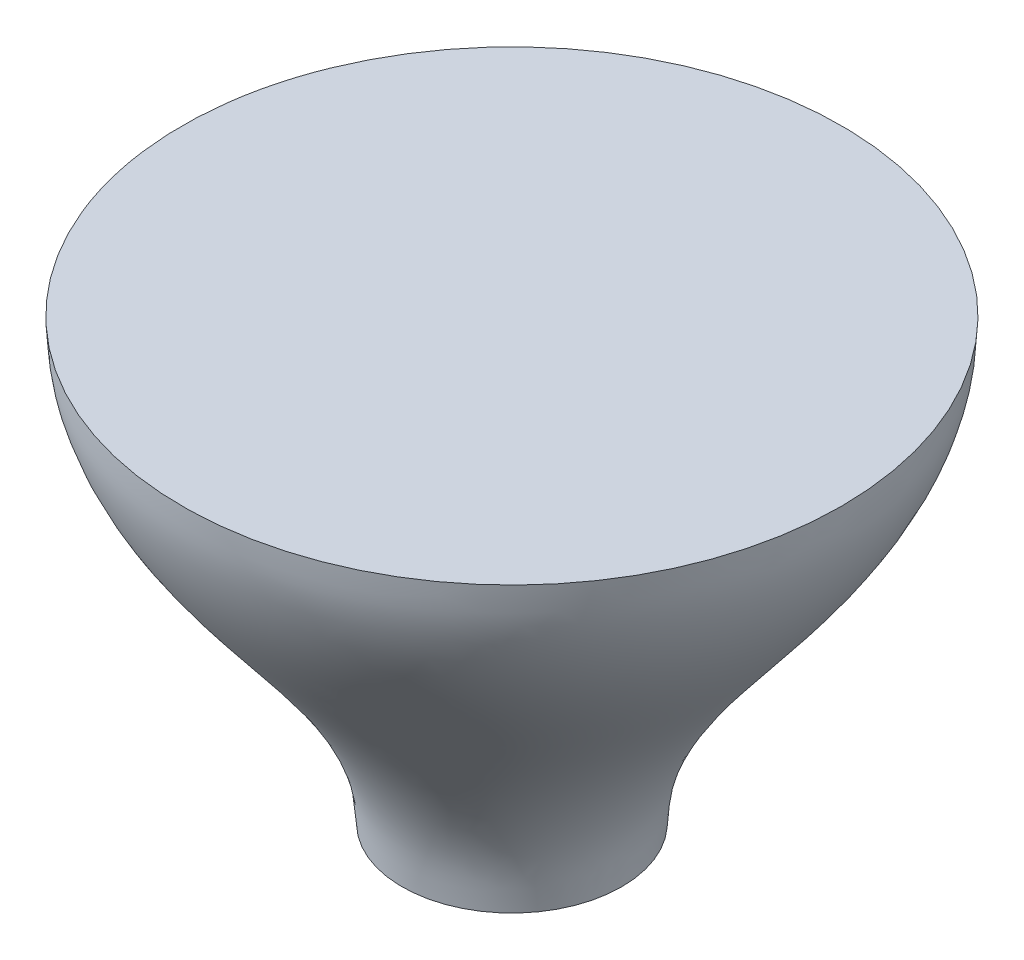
ISO-10303-21;
HEADER;
FILE_DESCRIPTION(('STEP AP214'),'2;1');
FILE_NAME('part.step','',(''),(''),'','','');
FILE_SCHEMA(('AUTOMOTIVE_DESIGN { 1 0 10303 214 1 1 1 1 }'));
ENDSEC;
DATA;
#1=APPLICATION_CONTEXT('core data for automotive mechanical design processes');
#2=APPLICATION_PROTOCOL_DEFINITION('international standard','automotive_design',2000,#1);
#3=PRODUCT_CONTEXT('',#1,'mechanical');
#4=PRODUCT('Part','Part','',(#3));
#5=PRODUCT_RELATED_PRODUCT_CATEGORY('part','',(#4));
#6=PRODUCT_DEFINITION_FORMATION('','',#4);
#7=PRODUCT_DEFINITION_CONTEXT('part definition',#1,'design');
#8=PRODUCT_DEFINITION('design','',#6,#7);
#9=PRODUCT_DEFINITION_SHAPE('','',#8);
#10=(LENGTH_UNIT() NAMED_UNIT(*) SI_UNIT(.MILLI.,.METRE.));
#11=(NAMED_UNIT(*) PLANE_ANGLE_UNIT() SI_UNIT($,.RADIAN.));
#12=(NAMED_UNIT(*) SI_UNIT($,.STERADIAN.) SOLID_ANGLE_UNIT());
#13=UNCERTAINTY_MEASURE_WITH_UNIT(LENGTH_MEASURE(1.E-05),#10,'distance_accuracy_value','');
#14=(GEOMETRIC_REPRESENTATION_CONTEXT(3) GLOBAL_UNCERTAINTY_ASSIGNED_CONTEXT((#13)) GLOBAL_UNIT_ASSIGNED_CONTEXT((#10,
#11,#12)) REPRESENTATION_CONTEXT('',''));
#15=CARTESIAN_POINT('',(0.,0.,0.));
#16=DIRECTION('',(0.,0.,1.));
#17=DIRECTION('',(1.,0.,0.));
#18=AXIS2_PLACEMENT_3D('',#15,#16,#17);
#19=CARTESIAN_POINT('',(0.,101.6,0.));
#20=DIRECTION('',(0.,1.,0.));
#21=DIRECTION('',(0.,0.,1.));
#22=AXIS2_PLACEMENT_3D('',#19,#20,#21);
#23=PLANE('',#22);
#24=CARTESIAN_POINT('',(0.,101.6,0.));
#25=DIRECTION('',(0.,1.,0.));
#26=DIRECTION('',(0.,0.,1.));
#27=AXIS2_PLACEMENT_3D('',#24,#25,#26);
#28=CIRCLE('',#27,76.2);
#29=CARTESIAN_POINT('',(76.2,101.6,0.));
#30=VERTEX_POINT('',#29);
#31=EDGE_CURVE('E12',#30,#30,#28,.T.);
#32=ORIENTED_EDGE('',*,*,#31,.T.);
#33=EDGE_LOOP('',(#32));
#34=FACE_BOUND('',#33,.T.);
#35=ADVANCED_FACE('F56',(#34),#23,.T.);
#36=CARTESIAN_POINT('',(0.,0.,0.));
#37=DIRECTION('',(0.,1.,0.));
#38=DIRECTION('',(0.,0.,1.));
#39=AXIS2_PLACEMENT_3D('',#36,#37,#38);
#40=PLANE('',#39);
#41=CARTESIAN_POINT('',(0.,0.,0.));
#42=DIRECTION('',(0.,1.,0.));
#43=DIRECTION('',(0.,0.,1.));
#44=AXIS2_PLACEMENT_3D('',#41,#42,#43);
#45=CIRCLE('',#44,25.4);
#46=CARTESIAN_POINT('',(25.4,0.,0.));
#47=VERTEX_POINT('',#46);
#48=EDGE_CURVE('E64',#47,#47,#45,.T.);
#49=ORIENTED_EDGE('',*,*,#48,.F.);
#50=EDGE_LOOP('',(#49));
#51=FACE_BOUND('',#50,.T.);
#52=ADVANCED_FACE('F87',(#51),#40,.F.);
#53=CARTESIAN_POINT('',(25.4,0.,0.));
#54=CARTESIAN_POINT('',(25.625234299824,3.27082678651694,0.));
#55=CARTESIAN_POINT('',(26.0864241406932,9.96817300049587,0.));
#56=CARTESIAN_POINT('',(30.3795417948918,21.9194697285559,0.));
#57=CARTESIAN_POINT('',(39.1503778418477,36.3958252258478,0.));
#58=CARTESIAN_POINT('',(51.3576448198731,51.4161676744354,0.));
#59=CARTESIAN_POINT('',(64.2054255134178,67.7573357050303,0.));
#60=CARTESIAN_POINT('',(72.3593506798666,81.6586239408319,0.));
#61=CARTESIAN_POINT('',(75.7849858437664,93.8357816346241,0.));
#62=CARTESIAN_POINT('',(76.063055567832,99.0379995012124,0.));
#63=CARTESIAN_POINT('',(76.2,101.6,0.));
#64=CARTESIAN_POINT('',(25.4,0.,-50.8));
#65=CARTESIAN_POINT('',(25.625234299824,3.27082678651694,-51.250468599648));
#66=CARTESIAN_POINT('',(26.0864241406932,9.96817300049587,-52.1728482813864));
#67=CARTESIAN_POINT('',(30.3795417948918,21.9194697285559,-60.7590835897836));
#68=CARTESIAN_POINT('',(39.1503778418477,36.3958252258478,-78.3007556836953));
#69=CARTESIAN_POINT('',(51.3576448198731,51.4161676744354,-102.715289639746));
#70=CARTESIAN_POINT('',(64.2054255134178,67.7573357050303,-128.410851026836));
#71=CARTESIAN_POINT('',(72.3593506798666,81.6586239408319,-144.718701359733));
#72=CARTESIAN_POINT('',(75.7849858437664,93.8357816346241,-151.569971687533));
#73=CARTESIAN_POINT('',(76.0630555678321,99.0379995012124,-152.126111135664));
#74=CARTESIAN_POINT('',(76.2,101.6,-152.4));
#75=CARTESIAN_POINT('',(-25.4,0.,-50.8));
#76=CARTESIAN_POINT('',(-25.625234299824,3.27082678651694,-51.250468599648));
#77=CARTESIAN_POINT('',(-26.0864241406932,9.96817300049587,-52.1728482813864));
#78=CARTESIAN_POINT('',(-30.3795417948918,21.9194697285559,-60.7590835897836));
#79=CARTESIAN_POINT('',(-39.1503778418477,36.3958252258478,-78.3007556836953));
#80=CARTESIAN_POINT('',(-51.3576448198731,51.4161676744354,-102.715289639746));
#81=CARTESIAN_POINT('',(-64.2054255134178,67.7573357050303,-128.410851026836));
#82=CARTESIAN_POINT('',(-72.3593506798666,81.6586239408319,-144.718701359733));
#83=CARTESIAN_POINT('',(-75.7849858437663,93.8357816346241,-151.569971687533));
#84=CARTESIAN_POINT('',(-76.063055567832,99.0379995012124,-152.126111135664));
#85=CARTESIAN_POINT('',(-76.2,101.6,-152.4));
#86=CARTESIAN_POINT('',(-25.4,0.,0.));
#87=CARTESIAN_POINT('',(-25.625234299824,3.27082678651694,0.));
#88=CARTESIAN_POINT('',(-26.0864241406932,9.96817300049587,0.));
#89=CARTESIAN_POINT('',(-30.3795417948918,21.9194697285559,0.));
#90=CARTESIAN_POINT('',(-39.1503778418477,36.3958252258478,0.));
#91=CARTESIAN_POINT('',(-51.3576448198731,51.4161676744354,0.));
#92=CARTESIAN_POINT('',(-64.2054255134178,67.7573357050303,0.));
#93=CARTESIAN_POINT('',(-72.3593506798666,81.6586239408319,0.));
#94=CARTESIAN_POINT('',(-75.7849858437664,93.8357816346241,0.));
#95=CARTESIAN_POINT('',(-76.063055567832,99.0379995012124,0.));
#96=CARTESIAN_POINT('',(-76.2,101.6,0.));
#97=CARTESIAN_POINT('',(-25.4,0.,50.8));
#98=CARTESIAN_POINT('',(-25.625234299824,3.27082678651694,51.250468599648));
#99=CARTESIAN_POINT('',(-26.0864241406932,9.96817300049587,52.1728482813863));
#100=CARTESIAN_POINT('',(-30.3795417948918,21.9194697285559,60.7590835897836));
#101=CARTESIAN_POINT('',(-39.1503778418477,36.3958252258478,78.3007556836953));
#102=CARTESIAN_POINT('',(-51.3576448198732,51.4161676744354,102.715289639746));
#103=CARTESIAN_POINT('',(-64.2054255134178,67.7573357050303,128.410851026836));
#104=CARTESIAN_POINT('',(-72.3593506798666,81.6586239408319,144.718701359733));
#105=CARTESIAN_POINT('',(-75.7849858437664,93.8357816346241,151.569971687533));
#106=CARTESIAN_POINT('',(-76.0630555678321,99.0379995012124,152.126111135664));
#107=CARTESIAN_POINT('',(-76.2,101.6,152.4));
#108=CARTESIAN_POINT('',(25.4,0.,50.8));
#109=CARTESIAN_POINT('',(25.625234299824,3.27082678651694,51.250468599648));
#110=CARTESIAN_POINT('',(26.0864241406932,9.96817300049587,52.1728482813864));
#111=CARTESIAN_POINT('',(30.3795417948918,21.9194697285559,60.7590835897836));
#112=CARTESIAN_POINT('',(39.1503778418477,36.3958252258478,78.3007556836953));
#113=CARTESIAN_POINT('',(51.3576448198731,51.4161676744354,102.715289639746));
#114=CARTESIAN_POINT('',(64.2054255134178,67.7573357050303,128.410851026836));
#115=CARTESIAN_POINT('',(72.3593506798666,81.6586239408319,144.718701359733));
#116=CARTESIAN_POINT('',(75.7849858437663,93.8357816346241,151.569971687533));
#117=CARTESIAN_POINT('',(76.063055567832,99.0379995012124,152.126111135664));
#118=CARTESIAN_POINT('',(76.2,101.6,152.4));
#119=CARTESIAN_POINT('',(25.4,0.,0.));
#120=CARTESIAN_POINT('',(25.625234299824,3.27082678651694,0.));
#121=CARTESIAN_POINT('',(26.0864241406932,9.96817300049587,0.));
#122=CARTESIAN_POINT('',(30.3795417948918,21.9194697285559,0.));
#123=CARTESIAN_POINT('',(39.1503778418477,36.3958252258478,0.));
#124=CARTESIAN_POINT('',(51.3576448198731,51.4161676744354,0.));
#125=CARTESIAN_POINT('',(64.2054255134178,67.7573357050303,0.));
#126=CARTESIAN_POINT('',(72.3593506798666,81.6586239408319,0.));
#127=CARTESIAN_POINT('',(75.7849858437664,93.8357816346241,0.));
#128=CARTESIAN_POINT('',(76.063055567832,99.0379995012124,0.));
#129=CARTESIAN_POINT('',(76.2,101.6,0.));
#130=(BOUNDED_SURFACE() B_SPLINE_SURFACE(3,3,((#53,#54,#55,#56,#57,#58,#59,#60,#61,#62,#63),
(#64,#65,#66,#67,#68,#69,#70,#71,#72,#73,#74),(#75,#76,#77,#78,#79,#80,#81,#82,#83,#84,#85),
(#86,#87,#88,#89,#90,#91,#92,#93,#94,#95,#96),(#97,#98,#99,#100,#101,#102,#103,#104,#105,#106,
#107),(#108,#109,#110,#111,#112,#113,#114,#115,#116,#117,#118),(#119,#120,#121,#122,#123,#124,
#125,#126,#127,#128,#129)),.UNSPECIFIED.,.T.,.F.,.F.) B_SPLINE_SURFACE_WITH_KNOTS((4,3,4),(4,1,
1,1,1,1,1,1,4),(0.,0.5,1.),(0.,0.0846319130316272,0.173292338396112,0.325773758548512,
0.521360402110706,0.674417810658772,0.865306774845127,0.933665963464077,1.),
.UNSPECIFIED.) GEOMETRIC_REPRESENTATION_ITEM() RATIONAL_B_SPLINE_SURFACE(((1.,1.,1.,1.,1.,1.,1.,
1.,1.,1.,1.),(0.333333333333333,0.333333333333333,0.333333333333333,0.333333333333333,
0.333333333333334,0.333333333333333,0.333333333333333,0.333333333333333,0.333333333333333,
0.333333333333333,0.333333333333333),(0.333333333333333,0.333333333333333,0.333333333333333,
0.333333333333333,0.333333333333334,0.333333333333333,0.333333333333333,0.333333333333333,
0.333333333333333,0.333333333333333,0.333333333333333),(1.,1.,1.,1.,1.,1.,1.,1.,1.,1.,1.),
(0.333333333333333,0.333333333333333,0.333333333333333,0.333333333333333,0.333333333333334,
0.333333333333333,0.333333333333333,0.333333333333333,0.333333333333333,0.333333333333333,
0.333333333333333),(0.333333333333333,0.333333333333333,0.333333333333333,0.333333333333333,
0.333333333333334,0.333333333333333,0.333333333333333,0.333333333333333,0.333333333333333,
0.333333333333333,0.333333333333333),(1.,1.,1.,1.,1.,1.,1.,1.,1.,1.,1.))) REPRESENTATION_ITEM('') SURFACE());
#131=CARTESIAN_POINT('',(25.4,0.,0.));
#132=CARTESIAN_POINT('',(25.405197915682,0.075483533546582,0.));
#133=CARTESIAN_POINT('',(25.4103958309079,0.15096706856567,0.));
#134=CARTESIAN_POINT('',(25.4208023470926,0.301932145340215,0.));
#135=CARTESIAN_POINT('',(25.4260109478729,0.377413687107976,0.));
#136=CARTESIAN_POINT('',(25.4364495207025,0.5283727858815,0.));
#137=CARTESIAN_POINT('',(25.4416794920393,0.603850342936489,0.));
#138=CARTESIAN_POINT('',(25.4521714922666,0.754799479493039,0.));
#139=CARTESIAN_POINT('',(25.4574335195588,0.830271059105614,0.));
#140=CARTESIAN_POINT('',(25.4680003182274,0.981206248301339,0.));
#141=CARTESIAN_POINT('',(25.4733050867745,1.05666985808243,0.));
#142=CARTESIAN_POINT('',(25.4839680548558,1.20758711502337,0.));
#143=CARTESIAN_POINT('',(25.4893262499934,1.28304076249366,0.));
#144=CARTESIAN_POINT('',(25.5001067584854,1.43393610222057,0.));
#145=CARTESIAN_POINT('',(25.5055290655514,1.50937779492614,0.));
#146=CARTESIAN_POINT('',(25.5164484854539,1.66024723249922,0.));
#147=CARTESIAN_POINT('',(25.5219455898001,1.73567497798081,0.));
#148=CARTESIAN_POINT('',(25.5330252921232,1.88651452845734,0.));
#149=CARTESIAN_POINT('',(25.5386078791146,1.96192633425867,0.));
#150=CARTESIAN_POINT('',(25.5498692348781,2.11273201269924,0.));
#151=CARTESIAN_POINT('',(25.5555479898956,2.18812588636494,0.));
#152=CARTESIAN_POINT('',(25.5670123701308,2.33889370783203,0.));
#153=CARTESIAN_POINT('',(25.5727979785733,2.41426765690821,0.));
#154=CARTESIAN_POINT('',(25.5844867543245,2.56499363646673,0.));
#155=CARTESIAN_POINT('',(25.5903899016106,2.64034566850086,0.));
#156=CARTESIAN_POINT('',(25.6023244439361,2.79102582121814,0.));
#157=CARTESIAN_POINT('',(25.6083558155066,2.866353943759,0.));
#158=CARTESIAN_POINT('',(25.6205574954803,3.01698428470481,0.));
#159=CARTESIAN_POINT('',(25.6267277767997,3.09228650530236,0.));
#160=CARTESIAN_POINT('',(25.6392179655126,3.24286304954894,0.));
#161=CARTESIAN_POINT('',(25.6455378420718,3.31813737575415,0.));
#162=CARTESIAN_POINT('',(25.6583379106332,3.46865613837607,0.));
#163=CARTESIAN_POINT('',(25.6648180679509,3.54390057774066,0.));
#164=CARTESIAN_POINT('',(25.6779493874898,3.69435757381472,0.));
#165=CARTESIAN_POINT('',(25.6846005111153,3.7695701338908,0.));
#166=CARTESIAN_POINT('',(25.6980844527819,3.91996137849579,0.));
#167=CARTESIAN_POINT('',(25.7049172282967,3.9951400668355,0.));
#168=CARTESIAN_POINT('',(25.7187751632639,4.14546157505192,0.));
#169=CARTESIAN_POINT('',(25.725800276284,4.22060439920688,0.));
#170=CARTESIAN_POINT('',(25.7400535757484,4.37085218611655,0.));
#171=CARTESIAN_POINT('',(25.7472817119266,4.4459571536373,0.));
#172=CARTESIAN_POINT('',(25.7619517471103,4.59612723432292,0.));
#173=CARTESIAN_POINT('',(25.7693935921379,4.6711923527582,0.));
#174=CARTESIAN_POINT('',(25.7845017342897,4.82128074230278,0.));
#175=CARTESIAN_POINT('',(25.7921679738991,4.89630401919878,0.));
#176=CARTESIAN_POINT('',(25.8077355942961,5.046306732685,0.));
#177=CARTESIAN_POINT('',(25.8156369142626,5.12128617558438,0.));
#178=CARTESIAN_POINT('',(25.8316853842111,5.27119922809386,0.));
#179=CARTESIAN_POINT('',(25.8398324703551,5.34613284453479,0.));
#180=CARTESIAN_POINT('',(25.8563831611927,5.49595225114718,0.));
#181=CARTESIAN_POINT('',(25.8647866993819,5.57083804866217,0.));
#182=CARTESIAN_POINT('',(25.8818609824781,5.72055982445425,0.));
#183=CARTESIAN_POINT('',(25.8905316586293,5.79539581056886,0.));
#184=CARTESIAN_POINT('',(25.9081509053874,5.94501597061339,0.));
#185=CARTESIAN_POINT('',(25.917099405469,6.01980015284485,0.));
#186=CARTESIAN_POINT('',(25.9352849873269,6.16931471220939,0.));
#187=CARTESIAN_POINT('',(25.9445219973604,6.24404509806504,0.));
#188=CARTESIAN_POINT('',(25.9632952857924,6.3934500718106,0.));
#189=CARTESIAN_POINT('',(25.9728314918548,6.46812466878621,0.));
#190=CARTESIAN_POINT('',(25.9922138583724,6.61741607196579,0.));
#191=CARTESIAN_POINT('',(26.0020599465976,6.69203288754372,0.));
#192=CARTESIAN_POINT('',(26.0220727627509,6.84120673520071,0.));
#193=CARTESIAN_POINT('',(26.0322394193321,6.91576377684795,0.));
#194=CARTESIAN_POINT('',(26.052904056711,7.06481608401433,0.));
#195=CARTESIAN_POINT('',(26.0634019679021,7.13931135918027,0.));
#196=CARTESIAN_POINT('',(26.0847397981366,7.28823814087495,0.));
#197=CARTESIAN_POINT('',(26.0955796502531,7.36266965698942,0.));
#198=CARTESIAN_POINT('',(26.1176120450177,7.51146692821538,0.));
#199=CARTESIAN_POINT('',(26.1288045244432,7.58583269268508,0.));
#200=CARTESIAN_POINT('',(26.1515528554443,7.73449646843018,0.));
#201=CARTESIAN_POINT('',(26.1631086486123,7.80879448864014,0.));
#202=CARTESIAN_POINT('',(26.1865942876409,7.95732078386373,0.));
#203=CARTESIAN_POINT('',(26.1985240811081,8.03154906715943,0.));
#204=CARTESIAN_POINT('',(26.2227683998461,8.17993389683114,0.));
#205=CARTESIAN_POINT('',(26.2350828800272,8.25409045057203,0.));
#206=CARTESIAN_POINT('',(26.2601072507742,8.402329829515,0.));
#207=CARTESIAN_POINT('',(26.272817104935,8.47641266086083,0.));
#208=CARTESIAN_POINT('',(26.298642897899,8.62450260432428,0.));
#209=CARTESIAN_POINT('',(26.3117588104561,8.69850972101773,0.));
#210=CARTESIAN_POINT('',(26.338407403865,8.84644624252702,0.));
#211=CARTESIAN_POINT('',(26.3519400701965,8.92037564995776,0.));
#212=CARTESIAN_POINT('',(26.3794328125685,9.06815476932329,0.));
#213=CARTESIAN_POINT('',(26.3933928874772,9.14200448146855,0.));
#214=CARTESIAN_POINT('',(26.4217512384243,9.28962219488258,0.));
#215=CARTESIAN_POINT('',(26.4361495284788,9.36339019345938,0.));
#216=CARTESIAN_POINT('',(26.4653945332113,9.51084258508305,0.));
#217=CARTESIAN_POINT('',(26.4802412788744,9.58452697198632,0.));
#218=CARTESIAN_POINT('',(26.510395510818,9.73180970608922,0.));
#219=CARTESIAN_POINT('',(26.5257030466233,9.80540804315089,0.));
#220=CARTESIAN_POINT('',(26.5567783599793,9.95251776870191,0.));
#221=CARTESIAN_POINT('',(26.5725461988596,10.0260291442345,0.));
#222=CARTESIAN_POINT('',(26.6045356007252,10.172964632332,0.));
#223=CARTESIAN_POINT('',(26.6207572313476,10.2463887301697,0.));
#224=CARTESIAN_POINT('',(26.6536491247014,10.3931490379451,0.));
#225=CARTESIAN_POINT('',(26.6703194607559,10.4664852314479,0.));
#226=CARTESIAN_POINT('',(26.7041032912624,10.6130691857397,0.));
#227=CARTESIAN_POINT('',(26.7212168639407,10.6863169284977,0.));
#228=CARTESIAN_POINT('',(26.7558817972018,10.8327234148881,0.));
#229=CARTESIAN_POINT('',(26.773433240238,10.905882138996,0.));
#230=CARTESIAN_POINT('',(26.8089685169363,11.0521100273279,0.));
#231=CARTESIAN_POINT('',(26.826952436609,11.125179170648,0.));
#232=CARTESIAN_POINT('',(26.8633472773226,11.2712273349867,0.));
#233=CARTESIAN_POINT('',(26.8817582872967,11.344206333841,0.));
#234=CARTESIAN_POINT('',(26.9190019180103,11.4900736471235,0.));
#235=CARTESIAN_POINT('',(26.9378346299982,11.5629619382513,0.));
#236=CARTESIAN_POINT('',(26.9759162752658,11.7086472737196,0.));
#237=CARTESIAN_POINT('',(26.9951653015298,11.781444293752,0.));
#238=CARTESIAN_POINT('',(27.0340741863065,11.9269465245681,0.));
#239=CARTESIAN_POINT('',(27.0537341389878,11.9996517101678,0.));
#240=CARTESIAN_POINT('',(27.0934594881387,12.1449697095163,0.));
#241=CARTESIAN_POINT('',(27.1135249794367,12.2175824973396,0.));
#242=CARTESIAN_POINT('',(27.1540560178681,12.3627151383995,0.));
#243=CARTESIAN_POINT('',(27.174521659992,12.4352349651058,0.));
#244=CARTESIAN_POINT('',(27.2158476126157,12.5801811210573,0.));
#245=CARTESIAN_POINT('',(27.236708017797,12.6526074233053,0.));
#246=CARTESIAN_POINT('',(27.2788181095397,12.7973659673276,0.));
#247=CARTESIAN_POINT('',(27.3000678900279,12.8696981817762,0.));
#248=CARTESIAN_POINT('',(27.3429513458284,13.0142679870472,0.));
#249=CARTESIAN_POINT('',(27.3645851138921,13.0865055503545,0.));
#250=CARTESIAN_POINT('',(27.4082311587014,13.2308854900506,0.));
#251=CARTESIAN_POINT('',(27.4302435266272,13.3030278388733,0.));
#252=CARTESIAN_POINT('',(27.4746413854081,13.4472167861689,0.));
#253=CARTESIAN_POINT('',(27.4970269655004,13.5192633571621,0.));
#254=CARTESIAN_POINT('',(27.5421658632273,13.6632601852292,0.));
#255=CARTESIAN_POINT('',(27.5649192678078,13.7352104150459,0.));
#256=CARTESIAN_POINT('',(27.6107884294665,13.8790139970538,0.));
#257=CARTESIAN_POINT('',(27.6339042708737,13.9508673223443,0.));
#258=CARTESIAN_POINT('',(27.6804929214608,14.0944765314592,0.));
#259=CARTESIAN_POINT('',(27.7039658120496,14.1662323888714,0.));
#260=CARTESIAN_POINT('',(27.7512631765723,14.3096460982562,0.));
#261=CARTESIAN_POINT('',(27.7750877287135,14.3813039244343,0.));
#262=CARTESIAN_POINT('',(27.8230830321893,14.5245210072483,0.));
#263=CARTESIAN_POINT('',(27.8472538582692,14.5960802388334,0.));
#264=CARTESIAN_POINT('',(27.8959363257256,14.7390995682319,0.));
#265=CARTESIAN_POINT('',(27.9204480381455,14.8105596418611,0.));
#266=CARTESIAN_POINT('',(27.9698068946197,14.9533800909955,0.));
#267=CARTESIAN_POINT('',(27.9946541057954,15.0247404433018,0.));
#268=CARTESIAN_POINT('',(28.0446785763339,15.1673608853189,0.));
#269=CARTESIAN_POINT('',(28.0698558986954,15.2386209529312,0.));
#270=CARTESIAN_POINT('',(28.1205352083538,15.3810402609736,0.));
#271=CARTESIAN_POINT('',(28.1460372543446,15.4521994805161,0.));
#272=CARTESIAN_POINT('',(28.1973606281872,15.5944165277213,0.));
#273=CARTESIAN_POINT('',(28.2231820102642,15.6654743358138,0.));
#274=CARTESIAN_POINT('',(28.2751386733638,15.8074879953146,0.));
#275=CARTESIAN_POINT('',(28.3012740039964,15.8784438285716,0.));
#276=CARTESIAN_POINT('',(28.3538531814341,16.0202529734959,0.));
#277=CARTESIAN_POINT('',(28.3802970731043,16.0911062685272,0.));
#278=CARTESIAN_POINT('',(28.4334879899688,16.2327097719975,0.));
#279=CARTESIAN_POINT('',(28.4602350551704,16.3034599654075,0.));
#280=CARTESIAN_POINT('',(28.5140269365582,16.4448567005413,0.));
#281=CARTESIAN_POINT('',(28.5410717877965,16.5155032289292,0.));
#282=CARTESIAN_POINT('',(28.5954538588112,16.6566920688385,0.));
#283=CARTESIAN_POINT('',(28.6227911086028,16.727234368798,0.));
#284=CARTESIAN_POINT('',(28.6777525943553,16.8682141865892,0.));
#285=CARTESIAN_POINT('',(28.7053768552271,16.9386516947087,0.));
#286=CARTESIAN_POINT('',(28.7609069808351,17.0794213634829,0.));
#287=CARTESIAN_POINT('',(28.7888128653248,17.1497535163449,0.));
#288=CARTESIAN_POINT('',(28.8449008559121,17.2903119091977,0.));
#289=CARTESIAN_POINT('',(28.8730829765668,17.3605381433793,0.));
#290=CARTESIAN_POINT('',(28.9297180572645,17.5008841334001,0.));
#291=CARTESIAN_POINT('',(28.9581710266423,17.5710038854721,0.));
#292=CARTESIAN_POINT('',(29.0153424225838,17.7111363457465,0.));
#293=CARTESIAN_POINT('',(29.0440608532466,17.7811490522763,0.));
#294=CARTESIAN_POINT('',(29.1017577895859,17.9210668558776,0.));
#295=CARTESIAN_POINT('',(29.130736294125,17.9909719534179,0.));
#296=CARTESIAN_POINT('',(29.1889479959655,18.1306739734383,0.));
#297=CARTESIAN_POINT('',(29.2181811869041,18.2004708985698,0.));
#298=CARTESIAN_POINT('',(29.2768968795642,18.3399560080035,0.));
#299=CARTESIAN_POINT('',(29.3063793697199,18.4096441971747,0.));
#300=CARTESIAN_POINT('',(29.365588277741,18.5489112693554,0.));
#301=CARTESIAN_POINT('',(29.3953146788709,18.6184901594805,0.));
#302=CARTESIAN_POINT('',(29.4550060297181,18.7575380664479,0.));
#303=CARTESIAN_POINT('',(29.4849709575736,18.8270070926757,0.));
#304=CARTESIAN_POINT('',(29.5451339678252,18.9658347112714,0.));
#305=CARTESIAN_POINT('',(29.575332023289,19.0351933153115,0.));
#306=CARTESIAN_POINT('',(29.6359559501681,19.1737995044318,0.));
#307=CARTESIAN_POINT('',(29.6663817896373,19.2430471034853,0.));
#308=CARTESIAN_POINT('',(29.7274557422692,19.3814307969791,0.));
#309=CARTESIAN_POINT('',(29.7581038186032,19.4505669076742,0.));
#310=CARTESIAN_POINT('',(29.8196178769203,19.5887275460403,0.));
#311=CARTESIAN_POINT('',(29.8504838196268,19.6577520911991,0.));
#312=CARTESIAN_POINT('',(29.9124322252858,19.7956898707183,0.));
#313=CARTESIAN_POINT('',(29.9435146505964,19.864603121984,0.));
#314=CARTESIAN_POINT('',(30.0058943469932,20.0023188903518,0.));
#315=CARTESIAN_POINT('',(30.0371915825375,20.0711214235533,0.));
#316=CARTESIAN_POINT('',(30.0999993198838,20.2086162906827,0.));
#317=CARTESIAN_POINT('',(30.1315097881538,20.2773086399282,0.));
#318=CARTESIAN_POINT('',(30.1947423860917,20.4145836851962,0.));
#319=CARTESIAN_POINT('',(30.2264644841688,20.4831663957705,0.));
#320=CARTESIAN_POINT('',(30.2901187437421,20.6202227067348,0.));
#321=CARTESIAN_POINT('',(30.3220508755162,20.6886963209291,0.));
#322=CARTESIAN_POINT('',(30.3861236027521,20.8255349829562,0.));
#323=CARTESIAN_POINT('',(30.4182641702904,20.893900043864,0.));
#324=CARTESIAN_POINT('',(30.482752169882,21.0305221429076,0.));
#325=CARTESIAN_POINT('',(30.5150995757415,21.0987791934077,0.));
#326=CARTESIAN_POINT('',(30.5799996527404,21.2351858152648,0.));
#327=CARTESIAN_POINT('',(30.6125522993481,21.3033353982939,0.));
#328=CARTESIAN_POINT('',(30.6778612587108,21.4395276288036,0.));
#329=CARTESIAN_POINT('',(30.7106175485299,21.5075702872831,0.));
#330=CARTESIAN_POINT('',(30.7763321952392,21.6435492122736,0.));
#331=CARTESIAN_POINT('',(30.8092905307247,21.7114854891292,0.));
#332=CARTESIAN_POINT('',(30.8754076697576,21.8472521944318,0.));
#333=CARTESIAN_POINT('',(30.9085664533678,21.9150826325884,0.));
#334=CARTESIAN_POINT('',(30.9750828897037,22.0506382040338,0.));
#335=CARTESIAN_POINT('',(31.0084405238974,22.1183633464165,0.));
#336=CARTESIAN_POINT('',(31.075353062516,22.2537088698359,0.));
#337=CARTESIAN_POINT('',(31.1089079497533,22.32132925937,0.));
#338=CARTESIAN_POINT('',(31.1762133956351,22.4564658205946,0.));
#339=CARTESIAN_POINT('',(31.209963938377,22.5239820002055,0.));
#340=CARTESIAN_POINT('',(31.2776590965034,22.6589106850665,0.));
#341=CARTESIAN_POINT('',(31.311603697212,22.7263231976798,0.));
#342=CARTESIAN_POINT('',(31.379685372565,22.8610450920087,0.));
#343=CARTESIAN_POINT('',(31.4138224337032,22.9283544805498,0.));
#344=CARTESIAN_POINT('',(31.4822874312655,23.0628706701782,0.));
#345=CARTESIAN_POINT('',(31.5166153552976,23.1300774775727,0.));
#346=CARTESIAN_POINT('',(31.5854604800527,23.2643890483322,0.));
#347=CARTESIAN_POINT('',(31.6199776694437,23.3314938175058,0.));
#348=CARTESIAN_POINT('',(31.6891997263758,23.4656018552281,0.));
#349=CARTESIAN_POINT('',(31.7239045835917,23.5326051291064,0.));
#350=CARTESIAN_POINT('',(31.7935003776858,23.6665107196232,0.));
#351=CARTESIAN_POINT('',(31.8283913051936,23.7334130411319,0.));
#352=CARTESIAN_POINT('',(31.8983576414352,23.867117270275,0.));
#353=CARTESIAN_POINT('',(31.9334330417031,23.9339191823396,0.));
#354=CARTESIAN_POINT('',(32.0037667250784,24.0674231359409,0.));
#355=CARTESIAN_POINT('',(32.0390250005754,24.1341251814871,0.));
#356=CARTESIAN_POINT('',(32.1097228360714,24.2674299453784,0.));
#357=CARTESIAN_POINT('',(32.1451623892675,24.3340326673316,0.));
#358=CARTESIAN_POINT('',(32.2162211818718,24.4671393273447,0.));
#359=CARTESIAN_POINT('',(32.2518404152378,24.5336432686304,0.));
#360=CARTESIAN_POINT('',(32.3232569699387,24.6665529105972,0.));
#361=CARTESIAN_POINT('',(32.3590542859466,24.7329586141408,0.));
#362=CARTESIAN_POINT('',(32.430825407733,24.8656723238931,0.));
#363=CARTESIAN_POINT('',(32.4667992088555,24.9319803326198,0.));
#364=CARTESIAN_POINT('',(32.538921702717,25.0644991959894,0.));
#365=CARTESIAN_POINT('',(32.5750703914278,25.1307100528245,0.));
#366=CARTESIAN_POINT('',(32.6475410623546,25.263035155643,0.));
#367=CARTESIAN_POINT('',(32.6838630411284,25.3291494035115,0.));
#368=CARTESIAN_POINT('',(32.7566786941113,25.4612818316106,0.));
#369=CARTESIAN_POINT('',(32.7931723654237,25.5273000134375,0.));
#370=CARTESIAN_POINT('',(32.866329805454,25.6592408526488,0.));
#371=CARTESIAN_POINT('',(32.9029935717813,25.7251635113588,0.));
#372=CARTESIAN_POINT('',(32.9764896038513,25.8569138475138,0.));
#373=CARTESIAN_POINT('',(33.0133218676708,25.9227415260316,0.));
#374=CARTESIAN_POINT('',(33.0871532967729,26.0543024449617,0.));
#375=CARTESIAN_POINT('',(33.1241524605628,26.1200356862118,0.));
#376=CARTESIAN_POINT('',(33.1983160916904,26.2514082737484,0.));
#377=CARTESIAN_POINT('',(33.2354805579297,26.317047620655,0.));
#378=CARTESIAN_POINT('',(33.3099731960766,26.4482329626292,0.));
#379=CARTESIAN_POINT('',(33.3473013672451,26.5137789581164,0.));
#380=CARTESIAN_POINT('',(33.4221198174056,26.6447781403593,0.));
#381=CARTESIAN_POINT('',(33.459610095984,26.7102313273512,0.));
#382=CARTESIAN_POINT('',(33.5347511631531,26.8410454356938,0.));
#383=CARTESIAN_POINT('',(33.572401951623,26.9064063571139,0.));
#384=CARTESIAN_POINT('',(33.6478624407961,27.037036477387,0.));
#385=CARTESIAN_POINT('',(33.6856721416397,27.1023056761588,0.));
#386=CARTESIAN_POINT('',(33.7614488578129,27.2327528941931,0.));
#387=CARTESIAN_POINT('',(33.7994158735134,27.29793091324,0.));
#388=CARTESIAN_POINT('',(33.8755056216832,27.428196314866,0.));
#389=CARTESIAN_POINT('',(33.9136283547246,27.493283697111,0.));
#390=CARTESIAN_POINT('',(33.990027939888,27.6233683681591,0.));
#391=CARTESIAN_POINT('',(34.0283047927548,27.6883656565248,0.));
#392=CARTESIAN_POINT('',(34.1050110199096,27.8182706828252,0.));
#393=CARTESIAN_POINT('',(34.1434403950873,27.8831784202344,0.));
#394=CARTESIAN_POINT('',(34.2204500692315,28.0129048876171,0.));
#395=CARTESIAN_POINT('',(34.2590303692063,28.077723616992,0.));
#396=CARTESIAN_POINT('',(34.3363402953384,28.2072726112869,0.));
#397=CARTESIAN_POINT('',(34.3750699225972,28.2720028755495,0.));
#398=CARTESIAN_POINT('',(34.4526769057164,28.4013754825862,0.));
#399=CARTESIAN_POINT('',(34.4915542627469,28.4660178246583,0.));
#400=CARTESIAN_POINT('',(34.5694551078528,28.5952151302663,0.));
#401=CARTESIAN_POINT('',(34.6084785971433,28.6597700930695,0.));
#402=CARTESIAN_POINT('',(34.6866701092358,28.788793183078,0.));
#403=CARTESIAN_POINT('',(34.7258381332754,28.8532613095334,0.));
#404=CARTESIAN_POINT('',(34.8043171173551,28.9821112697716,0.));
#405=CARTESIAN_POINT('',(34.8436280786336,29.0464931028,0.));
#406=CARTESIAN_POINT('',(34.9223913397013,29.1751710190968,0.));
#407=CARTESIAN_POINT('',(34.9618436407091,29.239467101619,0.));
#408=CARTESIAN_POINT('',(35.0408879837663,29.3679740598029,0.));
#409=CARTESIAN_POINT('',(35.0804800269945,29.4321849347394,0.));
#410=CARTESIAN_POINT('',(35.159802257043,29.5605220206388,0.));
#411=CARTESIAN_POINT('',(35.1995324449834,29.6246482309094,0.));
#412=CARTESIAN_POINT('',(35.2791293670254,29.7528165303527,0.));
#413=CARTESIAN_POINT('',(35.3189961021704,29.8168586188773,0.));
#414=CARTESIAN_POINT('',(35.3988645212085,29.9448592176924,0.));
#415=CARTESIAN_POINT('',(35.4388662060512,30.0088177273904,0.));
#416=CARTESIAN_POINT('',(35.5190029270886,30.136651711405,0.));
#417=CARTESIAN_POINT('',(35.5591379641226,30.2005271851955,0.));
#418=CARTESIAN_POINT('',(35.6395397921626,30.3281956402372,0.));
#419=CARTESIAN_POINT('',(35.6798065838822,30.3919886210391,0.));
#420=CARTESIAN_POINT('',(35.7604703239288,30.5194926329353,0.));
#421=CARTESIAN_POINT('',(35.8008672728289,30.583203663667,0.));
#422=CARTESIAN_POINT('',(35.8817897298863,30.7105443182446,0.));
#423=CARTESIAN_POINT('',(35.9223152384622,30.7741739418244,0.));
#424=CARTESIAN_POINT('',(36.0034932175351,30.9013523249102,0.));
#425=CARTESIAN_POINT('',(36.044145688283,30.964901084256,0.));
#426=CARTESIAN_POINT('',(36.1255759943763,31.0919182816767,0.));
#427=CARTESIAN_POINT('',(36.1663538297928,31.155386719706,0.));
#428=CARTESIAN_POINT('',(36.2480332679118,31.2822438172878,0.));
#429=CARTESIAN_POINT('',(36.288934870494,31.3456324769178,0.));
#430=CARTESIAN_POINT('',(36.3708602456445,31.4723305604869,0.));
#431=CARTESIAN_POINT('',(36.4118840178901,31.5356399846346,0.));
#432=CARTESIAN_POINT('',(36.4940521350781,31.6621801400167,0.));
#433=CARTESIAN_POINT('',(36.5351964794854,31.7254108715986,0.));
#434=CARTESIAN_POINT('',(36.6176041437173,31.8517941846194,0.));
#435=CARTESIAN_POINT('',(36.6588674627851,31.9149467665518,0.));
#436=CARTESIAN_POINT('',(36.7415114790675,32.0411743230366,0.));
#437=CARTESIAN_POINT('',(36.782892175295,32.1042492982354,0.));
#438=CARTESIAN_POINT('',(36.8657693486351,32.2303221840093,0.));
#439=CARTESIAN_POINT('',(36.9072658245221,32.2933200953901,0.));
#440=CARTESIAN_POINT('',(36.9903729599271,32.4192393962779,0.));
#441=CARTESIAN_POINT('',(37.031983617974,32.4821607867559,0.));
#442=CARTESIAN_POINT('',(37.1153175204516,32.6079275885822,0.));
#443=CARTESIAN_POINT('',(37.157040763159,32.6707730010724,0.));
#444=CARTESIAN_POINT('',(37.2405982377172,32.7963883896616,0.));
#445=CARTESIAN_POINT('',(37.2824324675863,32.8591583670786,0.));
#446=CARTESIAN_POINT('',(37.3662103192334,32.9846234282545,0.));
#447=CARTESIAN_POINT('',(37.4081539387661,33.0473185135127,0.));
#448=CARTESIAN_POINT('',(37.4921489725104,33.1726343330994,0.));
#449=CARTESIAN_POINT('',(37.5342003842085,33.2352550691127,0.));
#450=CARTESIAN_POINT('',(37.6184094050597,33.3604227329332,0.));
#451=CARTESIAN_POINT('',(37.6605670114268,33.4229696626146,0.));
#452=CARTESIAN_POINT('',(37.7449868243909,33.5479902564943,0.));
#453=CARTESIAN_POINT('',(37.787249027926,33.61046392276,0.));
#454=CARTESIAN_POINT('',(37.8718764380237,33.735338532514,0.));
#455=CARTESIAN_POINT('',(37.9142416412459,33.7977394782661,0.));
#456=CARTESIAN_POINT('',(37.9990734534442,33.9224691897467,0.));
#457=CARTESIAN_POINT('',(38.0415400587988,33.9847979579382,0.));
#458=CARTESIAN_POINT('',(38.1265730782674,34.1093838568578,0.));
#459=CARTESIAN_POINT('',(38.169139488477,34.1716409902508,0.));
#460=CARTESIAN_POINT('',(38.2543705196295,34.2960841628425,0.));
#461=CARTESIAN_POINT('',(38.2970351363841,34.3582702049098,0.));
#462=CARTESIAN_POINT('',(38.3824609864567,34.4825717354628,0.));
#463=CARTESIAN_POINT('',(38.4252222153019,34.5446872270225,0.));
#464=CARTESIAN_POINT('',(38.510839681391,34.6688482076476,0.));
#465=CARTESIAN_POINT('',(38.553695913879,34.7308936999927,0.));
#466=CARTESIAN_POINT('',(38.6395019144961,34.854915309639,0.));
#467=CARTESIAN_POINT('',(38.6824516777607,34.9168914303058,0.));
#468=CARTESIAN_POINT('',(38.768443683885,35.0407750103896,0.));
#469=CARTESIAN_POINT('',(38.8114859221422,35.1026824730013,0.));
#470=CARTESIAN_POINT('',(38.8976618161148,35.2264295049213,0.));
#471=CARTESIAN_POINT('',(38.9407954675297,35.2882690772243,0.));
#472=CARTESIAN_POINT('',(39.027153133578,35.4118810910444,0.));
#473=CARTESIAN_POINT('',(39.0703771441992,35.4736535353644,0.));
#474=CARTESIAN_POINT('',(39.1569144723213,35.5971320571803,0.));
#475=CARTESIAN_POINT('',(39.2002277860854,35.6588381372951,0.));
#476=CARTESIAN_POINT('',(39.2869426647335,35.7821846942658,0.));
#477=CARTESIAN_POINT('',(39.3303442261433,35.8438251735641,0.));
#478=CARTESIAN_POINT('',(39.417234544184,35.9670412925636,0.));
#479=CARTESIAN_POINT('',(39.4607232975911,36.0286169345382,0.));
#480=CARTESIAN_POINT('',(39.5477869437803,36.1517041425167,0.));
#481=CARTESIAN_POINT('',(39.591361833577,36.2132157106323,0.));
#482=CARTESIAN_POINT('',(39.6785966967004,36.3361755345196,0.));
#483=CARTESIAN_POINT('',(39.7222566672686,36.3976237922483,0.));
#484=CARTESIAN_POINT('',(39.8096606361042,36.5204577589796,0.));
#485=CARTESIAN_POINT('',(39.8534046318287,36.5818434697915,0.));
#486=CARTESIAN_POINT('',(39.9409755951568,36.7045531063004,0.));
#487=CARTESIAN_POINT('',(39.9848025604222,36.765877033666,0.));
#488=CARTESIAN_POINT('',(40.0725384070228,36.8884638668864,0.));
#489=CARTESIAN_POINT('',(40.1164472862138,36.9497267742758,0.));
#490=CARTESIAN_POINT('',(40.2043459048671,37.0721923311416,0.));
#491=CARTESIAN_POINT('',(40.2483356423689,37.1333949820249,0.));
#492=CARTESIAN_POINT('',(40.3363949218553,37.2557407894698,0.));
#493=CARTESIAN_POINT('',(40.3804644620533,37.3168839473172,0.));
#494=CARTESIAN_POINT('',(40.4686822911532,37.4391115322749,0.));
#495=CARTESIAN_POINT('',(40.512830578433,37.5001959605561,0.));
#496=CARTESIAN_POINT('',(40.6012048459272,37.6223068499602,0.));
#497=CARTESIAN_POINT('',(40.6454308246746,37.6833333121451,0.));
#498=CARTESIAN_POINT('',(40.7339594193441,37.8053290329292,0.));
#499=CARTESIAN_POINT('',(40.7782620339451,37.8662982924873,0.));
#500=CARTESIAN_POINT('',(40.8669428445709,37.988180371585,0.));
#501=CARTESIAN_POINT('',(40.9113210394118,38.0490931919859,0.));
#502=CARTESIAN_POINT('',(41.0001519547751,38.1708631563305,0.));
#503=CARTESIAN_POINT('',(41.0446046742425,38.2317203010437,0.));
#504=CARTESIAN_POINT('',(41.1335835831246,38.3533796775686,0.));
#505=CARTESIAN_POINT('',(41.1781097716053,38.4141819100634,0.));
#506=CARTESIAN_POINT('',(41.2672345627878,38.5357322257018,0.));
#507=CARTESIAN_POINT('',(41.3118331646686,38.5964803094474,0.));
#508=CARTESIAN_POINT('',(41.4011017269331,38.7179230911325,0.));
#509=CARTESIAN_POINT('',(41.4457716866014,38.778617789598,0.));
#510=CARTESIAN_POINT('',(41.5351819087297,38.8999545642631,0.));
#511=CARTESIAN_POINT('',(41.5799221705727,38.9605966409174,0.));
#512=CARTESIAN_POINT('',(41.6694719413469,39.0818289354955,0.));
#513=CARTESIAN_POINT('',(41.7142814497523,39.1424191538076,0.));
#514=CARTESIAN_POINT('',(41.8039686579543,39.2635484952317,0.));
#515=CARTESIAN_POINT('',(41.8488463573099,39.3240876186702,0.));
#516=CARTESIAN_POINT('',(41.9386688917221,39.4451155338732,0.));
#517=CARTESIAN_POINT('',(41.9836137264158,39.5056043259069,0.));
#518=CARTESIAN_POINT('',(42.0735694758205,39.6265323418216,0.));
#519=CARTESIAN_POINT('',(42.1185803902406,39.686971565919,0.));
#520=CARTESIAN_POINT('',(42.2086672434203,39.8078012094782,0.));
#521=CARTESIAN_POINT('',(42.2537431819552,39.8681916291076,0.));
#522=CARTESIAN_POINT('',(42.3439590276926,39.9889244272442,0.));
#523=CARTESIAN_POINT('',(42.3890989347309,40.049266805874,0.));
#524=CARTESIAN_POINT('',(42.4794416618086,40.1699042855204,0.));
#525=CARTESIAN_POINT('',(42.524644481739,40.2301993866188,0.));
#526=CARTESIAN_POINT('',(42.61511197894,40.3507430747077,0.));
#527=CARTESIAN_POINT('',(42.6603766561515,40.4109916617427,0.));
#528=CARTESIAN_POINT('',(42.7509668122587,40.5314430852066,0.));
#529=CARTESIAN_POINT('',(42.7962922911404,40.5916459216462,0.));
#530=CARTESIAN_POINT('',(42.8870029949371,40.7120066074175,0.));
#531=CARTESIAN_POINT('',(42.9323882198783,40.7721644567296,0.));
#532=CARTESIAN_POINT('',(43.0232173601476,40.8924359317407,0.));
#533=CARTESIAN_POINT('',(43.0686612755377,40.9525495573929,0.));
#534=CARTESIAN_POINT('',(43.159606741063,41.0727333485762,0.));
#535=CARTESIAN_POINT('',(43.2051082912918,41.1328035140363,0.));
#536=CARTESIAN_POINT('',(43.2961679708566,41.2529011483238,0.));
#537=CARTESIAN_POINT('',(43.3417261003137,41.3129286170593,0.));
#538=CARTESIAN_POINT('',(43.4328978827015,41.4329416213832,0.));
#539=CARTESIAN_POINT('',(43.478511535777,41.4929271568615,0.));
#540=CARTESIAN_POINT('',(43.5697933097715,41.612857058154,0.));
#541=CARTESIAN_POINT('',(43.6154614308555,41.6728014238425,0.));
#542=CARTESIAN_POINT('',(43.7068510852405,41.7926497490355,0.));
#543=CARTESIAN_POINT('',(43.7525726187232,41.8525537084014,0.));
#544=CARTESIAN_POINT('',(43.8440680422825,41.9723219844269,0.));
#545=CARTESIAN_POINT('',(43.8898419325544,42.0321863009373,0.));
#546=CARTESIAN_POINT('',(43.9814410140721,42.1518760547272,0.));
#547=CARTESIAN_POINT('',(44.0272662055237,42.2117014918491,0.));
#548=CARTESIAN_POINT('',(44.1189668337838,42.3313142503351,0.));
#549=CARTESIAN_POINT('',(44.1648422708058,42.3911015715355,0.));
#550=CARTESIAN_POINT('',(44.2566423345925,42.5106388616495,0.));
#551=CARTESIAN_POINT('',(44.3025669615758,42.5703888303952,0.));
#552=CARTESIAN_POINT('',(44.3944643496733,42.6898521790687,0.));
#553=CARTESIAN_POINT('',(44.4404371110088,42.7495655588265,0.));
#554=CARTESIAN_POINT('',(44.5324297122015,42.8689564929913,0.));
#555=CARTESIAN_POINT('',(44.5784495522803,42.9286340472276,0.));
#556=CARTESIAN_POINT('',(44.6705352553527,43.0479540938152,0.));
#557=CARTESIAN_POINT('',(44.7166011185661,43.1075965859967,0.));
#558=CARTESIAN_POINT('',(44.8087778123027,43.2268472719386,0.));
#559=CARTESIAN_POINT('',(44.854888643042,43.2864554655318,0.));
#560=CARTESIAN_POINT('',(44.9471542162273,43.4056383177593,0.));
#561=CARTESIAN_POINT('',(44.993308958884,43.4652129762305,0.));
#562=CARTESIAN_POINT('',(45.0856613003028,43.5843295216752,0.));
#563=CARTESIAN_POINT('',(45.1318588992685,43.6438714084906,0.));
#564=CARTESIAN_POINT('',(45.2242958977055,43.7629231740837,0.));
#565=CARTESIAN_POINT('',(45.270535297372,43.8224330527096,0.));
#566=CARTESIAN_POINT('',(45.363054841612,43.9414215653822,0.));
#567=CARTESIAN_POINT('',(45.409334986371,44.0009001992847,0.));
#568=CARTESIAN_POINT('',(45.501934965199,44.1198269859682,0.));
#569=CARTESIAN_POINT('',(45.5482547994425,44.1792751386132,0.));
#570=CARTESIAN_POINT('',(45.6409331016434,44.2981417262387,0.));
#571=CARTESIAN_POINT('',(45.6872915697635,44.3575601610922,0.));
#572=CARTESIAN_POINT('',(45.7800460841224,44.4763680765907,0.));
#573=CARTESIAN_POINT('',(45.8264421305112,44.5357575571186,0.));
#574=CARTESIAN_POINT('',(45.9192707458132,44.6545083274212,0.));
#575=CARTESIAN_POINT('',(45.9657033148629,44.7138696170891,0.));
#576=CARTESIAN_POINT('',(46.0586039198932,44.8325647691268,0.));
#577=CARTESIAN_POINT('',(46.1050719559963,44.8918986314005,0.));
#578=CARTESIAN_POINT('',(46.19804243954,45.0105396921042,0.));
#579=CARTESIAN_POINT('',(46.2445448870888,45.0698468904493,0.));
#580=CARTESIAN_POINT('',(46.3375831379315,45.1884353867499,0.));
#581=CARTESIAN_POINT('',(46.3841189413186,45.247716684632,0.));
#582=CARTESIAN_POINT('',(46.4772228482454,45.3662541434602,0.));
#583=CARTESIAN_POINT('',(46.5237909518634,45.4255103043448,0.));
#584=CARTESIAN_POINT('',(46.6169584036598,45.5439982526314,0.));
#585=CARTESIAN_POINT('',(46.6635577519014,45.6032300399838,0.));
#586=CARTESIAN_POINT('',(46.7567866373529,45.7216700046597,0.));
#587=CARTESIAN_POINT('',(46.8034161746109,45.7808781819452,0.));
#588=CARTESIAN_POINT('',(46.896704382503,45.899271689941,0.));
#589=CARTESIAN_POINT('',(46.9433630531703,45.958457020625,0.));
#590=CARTESIAN_POINT('',(47.0367084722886,46.0768055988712,0.));
#591=CARTESIAN_POINT('',(47.0833952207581,46.1359688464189,0.));
#592=CARTESIAN_POINT('',(47.1767957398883,46.2542740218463,0.));
#593=CARTESIAN_POINT('',(47.223509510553,46.3134159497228,0.));
#594=CARTESIAN_POINT('',(47.3169630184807,46.4316792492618,0.));
#595=CARTESIAN_POINT('',(47.3637027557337,46.4908006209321,0.));
#596=CARTESIAN_POINT('',(47.4572071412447,46.6090235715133,0.));
#597=CARTESIAN_POINT('',(47.5039717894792,46.6681251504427,0.));
#598=CARTESIAN_POINT('',(47.5975249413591,46.7863092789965,0.));
#599=CARTESIAN_POINT('',(47.6443134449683,46.8453918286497,0.));
#600=CARTESIAN_POINT('',(47.7379132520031,46.9635386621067,0.));
#601=CARTESIAN_POINT('',(47.7847245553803,47.0226029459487,0.));
#602=CARTESIAN_POINT('',(47.8783689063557,47.1407140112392,0.));
#603=CARTESIAN_POINT('',(47.9252019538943,47.1997607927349,0.));
#604=CARTESIAN_POINT('',(48.0188887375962,47.3178376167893,0.));
#605=CARTESIAN_POINT('',(48.0657424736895,47.3768676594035,0.));
#606=CARTESIAN_POINT('',(48.159469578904,47.4949117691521,0.));
#607=CARTESIAN_POINT('',(48.2063429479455,47.5539258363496,0.));
#608=CARTESIAN_POINT('',(48.3001082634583,47.6719387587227,0.));
#609=CARTESIAN_POINT('',(48.3470002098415,47.7309376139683,0.));
#610=CARTESIAN_POINT('',(48.4408016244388,47.8489208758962,0.));
#611=CARTESIAN_POINT('',(48.4877110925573,47.9079052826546,0.));
#612=CARTESIAN_POINT('',(48.581546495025,48.0258604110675,0.));
#613=CARTESIAN_POINT('',(48.6284724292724,48.0848311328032,0.));
#614=CARTESIAN_POINT('',(48.7223397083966,48.2027596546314,0.));
#615=CARTESIAN_POINT('',(48.7692810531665,48.2617174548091,0.));
#616=CARTESIAN_POINT('',(48.8631780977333,48.3796208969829,0.));
#617=CARTESIAN_POINT('',(48.9101337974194,48.4385665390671,0.));
#618=CARTESIAN_POINT('',(49.0040584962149,48.5564464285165,0.));
#619=CARTESIAN_POINT('',(49.051027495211,48.6153806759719,0.));
#620=CARTESIAN_POINT('',(49.1449777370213,48.7332385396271,0.));
#621=CARTESIAN_POINT('',(49.1919589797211,48.7921621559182,0.));
#622=CARTESIAN_POINT('',(49.2859326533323,48.9099995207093,0.));
#623=CARTESIAN_POINT('',(49.3329250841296,48.9689132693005,0.));
#624=CARTESIAN_POINT('',(49.4269200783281,49.0867316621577,0.));
#625=CARTESIAN_POINT('',(49.4739226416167,49.1456363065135,0.));
#626=CARTESIAN_POINT('',(49.5679368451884,49.2634372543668,0.));
#627=CARTESIAN_POINT('',(49.6149484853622,49.3223335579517,0.));
#628=CARTESIAN_POINT('',(49.7089797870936,49.4401185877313,0.));
#629=CARTESIAN_POINT('',(49.7559994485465,49.4990073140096,0.));
#630=CARTESIAN_POINT('',(49.8500457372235,49.6167779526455,0.));
#631=CARTESIAN_POINT('',(49.8970723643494,49.6756598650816,0.));
#632=CARTESIAN_POINT('',(49.9911315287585,49.793417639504,0.));
#633=CARTESIAN_POINT('',(50.0381640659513,49.8522935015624,0.));
#634=CARTESIAN_POINT('',(50.1322339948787,49.9700399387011,0.));
#635=CARTESIAN_POINT('',(50.1792713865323,50.0289105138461,0.));
#636=CARTESIAN_POINT('',(50.2733499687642,50.1466471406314,0.));
#637=CARTESIAN_POINT('',(50.3203911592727,50.2055131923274,0.));
#638=CARTESIAN_POINT('',(50.4144762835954,50.3232415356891,0.));
#639=CARTESIAN_POINT('',(50.4615202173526,50.3821038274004,0.));
#640=CARTESIAN_POINT('',(50.5556097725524,50.4998254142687,0.));
#641=CARTESIAN_POINT('',(50.6026553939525,50.5586847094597,0.));
#642=CARTESIAN_POINT('',(50.6967472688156,50.6764010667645,0.));
#643=CARTESIAN_POINT('',(50.7437935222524,50.7352581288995,0.));
#644=CARTESIAN_POINT('',(50.8378856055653,50.852970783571,0.));
#645=CARTESIAN_POINT('',(50.8849314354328,50.9118263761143,0.));
#646=CARTESIAN_POINT('',(50.9790216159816,51.0295368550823,0.));
#647=CARTESIAN_POINT('',(51.0260659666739,51.0883917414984,0.));
#648=CARTESIAN_POINT('',(51.120152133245,51.2061015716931,0.));
#649=CARTESIAN_POINT('',(51.167193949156,51.2649565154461,0.));
#650=CARTESIAN_POINT('',(51.2612739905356,51.3826672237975,0.));
#651=CARTESIAN_POINT('',(51.3083122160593,51.4415229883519,0.));
#652=CARTESIAN_POINT('',(51.4023840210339,51.5592361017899,0.));
#653=CARTESIAN_POINT('',(51.4494176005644,51.61809345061,0.));
#654=CARTESIAN_POINT('',(51.5434790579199,51.735810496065,0.));
#655=CARTESIAN_POINT('',(51.5905069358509,51.7946701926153,0.));
#656=CARTESIAN_POINT('',(51.6845559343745,51.9123926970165,0.));
#657=CARTESIAN_POINT('',(51.731577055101,51.9712555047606,0.));
#658=CARTESIAN_POINT('',(51.825611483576,52.0889849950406,0.));
#659=CARTESIAN_POINT('',(51.8726247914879,52.1478516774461,0.));
#660=CARTESIAN_POINT('',(51.9666425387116,52.265589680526,0.));
#661=CARTESIAN_POINT('',(52.0136469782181,52.3244610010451,0.));
#662=CARTESIAN_POINT('',(52.1076459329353,52.4422090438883,0.));
#663=CARTESIAN_POINT('',(52.1546404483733,52.501085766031,0.));
#664=CARTESIAN_POINT('',(52.2486184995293,52.6188453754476,0.));
#665=CARTESIAN_POINT('',(52.2956020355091,52.6777282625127,0.));
#666=CARTESIAN_POINT('',(52.3895570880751,52.7955009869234,0.));
#667=CARTESIAN_POINT('',(52.4365286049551,52.8543908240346,0.));
#668=CARTESIAN_POINT('',(52.5304586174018,52.9721783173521,0.));
#669=CARTESIAN_POINT('',(52.5774171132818,53.0310759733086,0.));
#670=CARTESIAN_POINT('',(52.6713200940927,53.1488799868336,0.));
#671=CARTESIAN_POINT('',(52.7182645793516,53.2077863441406,0.));
#672=CARTESIAN_POINT('',(52.8121385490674,53.3256086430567,0.));
#673=CARTESIAN_POINT('',(52.8590680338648,53.3845245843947,0.));
#674=CARTESIAN_POINT('',(52.9529110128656,53.5023669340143,0.));
#675=CARTESIAN_POINT('',(52.9998245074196,53.5612933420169,0.));
#676=CARTESIAN_POINT('',(53.0936345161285,53.6791575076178,0.));
#677=CARTESIAN_POINT('',(53.1405310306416,53.738095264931,0.));
#678=CARTESIAN_POINT('',(53.2343060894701,53.8559830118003,0.));
#679=CARTESIAN_POINT('',(53.2811846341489,53.9149330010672,0.));
#680=CARTESIAN_POINT('',(53.3749227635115,54.0328460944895,0.));
#681=CARTESIAN_POINT('',(53.4217823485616,54.0918091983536,0.));
#682=CARTESIAN_POINT('',(53.5154815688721,54.2097494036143,0.));
#683=CARTESIAN_POINT('',(53.5623212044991,54.2687265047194,0.));
#684=CARTESIAN_POINT('',(53.6559795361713,54.3866955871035,0.));
#685=CARTESIAN_POINT('',(53.7027982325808,54.4456875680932,0.));
#686=CARTESIAN_POINT('',(53.7964136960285,54.5636872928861,0.));
#687=CARTESIAN_POINT('',(53.843210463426,54.6226950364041,0.));
#688=CARTESIAN_POINT('',(53.9367810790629,54.740727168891,0.));
#689=CARTESIAN_POINT('',(53.983554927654,54.799751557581,0.));
#690=CARTESIAN_POINT('',(54.0770787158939,54.9178178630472,0.));
#691=CARTESIAN_POINT('',(54.1238286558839,54.9768597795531,0.));
#692=CARTESIAN_POINT('',(54.2173036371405,55.0949620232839,0.));
#693=CARTESIAN_POINT('',(54.2640286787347,55.1540223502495,0.));
#694=CARTESIAN_POINT('',(54.3574528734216,55.2721622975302,0.));
#695=CARTESIAN_POINT('',(54.4041520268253,55.3312419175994,0.));
#696=CARTESIAN_POINT('',(54.4975234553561,55.4494213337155,0.));
#697=CARTESIAN_POINT('',(54.5441957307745,55.5085211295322,0.));
#698=CARTESIAN_POINT('',(54.6375124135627,55.626741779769,0.));
#699=CARTESIAN_POINT('',(54.6841568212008,55.6858626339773,0.));
#700=CARTESIAN_POINT('',(54.7774167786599,55.8041262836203,0.));
#701=CARTESIAN_POINT('',(54.8240323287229,55.8632690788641,0.));
#702=CARTESIAN_POINT('',(54.9172335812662,55.9815774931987,0.));
#703=CARTESIAN_POINT('',(54.963819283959,56.0407431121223,0.));
#704=CARTESIAN_POINT('',(55.056959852,56.1590980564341,0.));
#705=CARTESIAN_POINT('',(55.1035147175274,56.2182873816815,0.));
#706=CARTESIAN_POINT('',(55.1965926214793,56.3366906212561,0.));
#707=CARTESIAN_POINT('',(55.2431156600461,56.3959045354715,0.));
#708=CARTESIAN_POINT('',(55.3361289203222,56.5143578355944,0.));
#709=CARTESIAN_POINT('',(55.3826191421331,56.5735972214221,0.));
#710=CARTESIAN_POINT('',(55.4755657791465,56.692102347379,0.));
#711=CARTESIAN_POINT('',(55.522022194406,56.7513680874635,0.));
#712=CARTESIAN_POINT('',(55.6149002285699,56.8699268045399,0.));
#713=CARTESIAN_POINT('',(55.6613218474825,56.9292197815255,0.));
#714=CARTESIAN_POINT('',(55.7541292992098,57.0478338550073,0.));
#715=CARTESIAN_POINT('',(55.8005151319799,57.1071549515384,0.));
#716=CARTESIAN_POINT('',(55.8932500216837,57.2258261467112,0.));
#717=CARTESIAN_POINT('',(55.9395990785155,57.2851762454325,0.));
#718=CARTESIAN_POINT('',(56.0322594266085,57.4039063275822,0.));
#719=CARTESIAN_POINT('',(56.0785707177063,57.4632863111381,0.));
#720=CARTESIAN_POINT('',(56.1711545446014,57.5820770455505,0.));
#721=CARTESIAN_POINT('',(56.2174270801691,57.6414877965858,0.));
#722=CARTESIAN_POINT('',(56.3099324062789,57.7603409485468,0.));
#723=CARTESIAN_POINT('',(56.3561651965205,57.8197833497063,0.));
#724=CARTESIAN_POINT('',(56.4485900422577,57.9387006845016,0.));
#725=CARTESIAN_POINT('',(56.494782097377,57.9981756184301,0.));
#726=CARTESIAN_POINT('',(56.5871244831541,58.1171589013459,0.));
#727=CARTESIAN_POINT('',(56.6332748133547,58.1766672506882,0.));
#728=CARTESIAN_POINT('',(56.7255327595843,58.2957182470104,0.));
#729=CARTESIAN_POINT('',(56.7716403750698,58.3552608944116,0.));
#730=CARTESIAN_POINT('',(56.8638119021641,58.4743813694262,0.));
#731=CARTESIAN_POINT('',(56.9098758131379,58.5339591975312,0.));
#732=CARTESIAN_POINT('',(57.0019589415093,58.6531509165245,0.));
#733=CARTESIAN_POINT('',(57.0479781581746,58.7127648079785,0.));
#734=CARTESIAN_POINT('',(57.1399709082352,58.8320295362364,0.));
#735=CARTESIAN_POINT('',(57.1859444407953,58.8916803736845,0.));
#736=CARTESIAN_POINT('',(57.2778448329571,59.0110198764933,0.));
#737=CARTESIAN_POINT('',(57.3237716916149,59.070708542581,0.));
#738=CARTESIAN_POINT('',(57.41557774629,59.1901245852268,0.));
#739=CARTESIAN_POINT('',(57.4614569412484,59.2498519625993,0.));
#740=CARTESIAN_POINT('',(57.5531666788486,59.3693463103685,0.));
#741=CARTESIAN_POINT('',(57.5989972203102,59.4291132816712,0.));
#742=CARTESIAN_POINT('',(57.6906086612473,59.5486876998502,0.));
#743=CARTESIAN_POINT('',(57.7363895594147,59.6084951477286,0.));
#744=CARTESIAN_POINT('',(57.8279007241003,59.7281514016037,0.));
#745=CARTESIAN_POINT('',(57.8736309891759,59.7880002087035,0.));
#746=CARTESIAN_POINT('',(57.9650398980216,59.907740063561,0.));
#747=CARTESIAN_POINT('',(58.0107185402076,59.9676311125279,0.));
#748=CARTESIAN_POINT('',(58.1020232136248,60.0874563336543,0.));
#749=CARTESIAN_POINT('',(58.1476492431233,60.147390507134,0.));
#750=CARTESIAN_POINT('',(58.2388477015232,60.2673028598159,0.));
#751=CARTESIAN_POINT('',(58.2844201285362,60.3272810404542,0.));
#752=CARTESIAN_POINT('',(58.37551039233,60.4472822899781,0.));
#753=CARTESIAN_POINT('',(58.4210282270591,60.5073053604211,0.));
#754=CARTESIAN_POINT('',(58.512008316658,60.6273972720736,0.));
#755=CARTESIAN_POINT('',(58.5574705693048,60.6874661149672,0.));
#756=CARTESIAN_POINT('',(58.6483385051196,60.807650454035,0.));
#757=CARTESIAN_POINT('',(58.6937441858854,60.8677659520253,0.));
#758=CARTESIAN_POINT('',(58.784497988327,60.988044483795,0.));
#759=CARTESIAN_POINT('',(58.8298461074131,61.0482075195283,0.));
#760=CARTESIAN_POINT('',(58.920483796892,61.1685820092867,0.));
#761=CARTESIAN_POINT('',(58.9657733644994,61.2287934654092,0.));
#762=CARTESIAN_POINT('',(59.0562929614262,61.3492656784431,0.));
#763=CARTESIAN_POINT('',(59.1015229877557,61.4095264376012,0.));
#764=CARTESIAN_POINT('',(59.1919225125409,61.5300981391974,0.));
#765=CARTESIAN_POINT('',(59.237092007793,61.5904090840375,0.));
#766=CARTESIAN_POINT('',(59.3273694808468,61.7110820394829,0.));
#767=CARTESIAN_POINT('',(59.372477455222,61.7714440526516,0.));
#768=CARTESIAN_POINT('',(59.4626308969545,61.8922200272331,0.));
#769=CARTESIAN_POINT('',(59.5076763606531,61.952633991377,0.));
#770=CARTESIAN_POINT('',(59.5977037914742,62.0735147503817,0.));
#771=CARTESIAN_POINT('',(59.6426857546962,62.1339815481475,0.));
#772=CARTESIAN_POINT('',(59.7325851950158,62.2549688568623,0.));
#773=CARTESIAN_POINT('',(59.7775026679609,62.3154893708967,0.));
#774=CARTESIAN_POINT('',(59.8672721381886,62.4365849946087,0.));
#775=CARTESIAN_POINT('',(59.9121241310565,62.4971601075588,0.));
#776=CARTESIAN_POINT('',(60.0017616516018,62.6183658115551,0.));
#777=CARTESIAN_POINT('',(60.0465471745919,62.6789964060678,0.));
#778=CARTESIAN_POINT('',(60.1360507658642,62.8003139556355,0.));
#779=CARTESIAN_POINT('',(60.1807688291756,62.8610009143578,0.));
#780=CARTESIAN_POINT('',(60.270136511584,62.9824320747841,0.));
#781=CARTESIAN_POINT('',(60.3147861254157,63.0431762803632,0.));
#782=CARTESIAN_POINT('',(60.4040159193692,63.1647228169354,0.));
#783=CARTESIAN_POINT('',(60.44859609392,63.2255251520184,0.));
#784=CARTESIAN_POINT('',(60.5376860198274,63.3471888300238,0.));
#785=CARTESIAN_POINT('',(60.5821957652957,63.4080501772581,0.));
#786=CARTESIAN_POINT('',(60.6711438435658,63.5298327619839,0.));
#787=CARTESIAN_POINT('',(60.7155821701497,63.5907540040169,0.));
#788=CARTESIAN_POINT('',(60.804386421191,63.7126572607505,0.));
#789=CARTESIAN_POINT('',(60.8487523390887,63.7736392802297,0.));
#790=CARTESIAN_POINT('',(60.9374107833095,63.8956649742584,0.));
#791=CARTESIAN_POINT('',(60.9817033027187,63.9567086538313,0.));
#792=CARTESIAN_POINT('',(61.070213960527,64.0788585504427,0.));
#793=CARTESIAN_POINT('',(61.1144320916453,64.139964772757,0.));
#794=CARTESIAN_POINT('',(61.2027929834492,64.2622406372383,0.));
#795=CARTESIAN_POINT('',(61.2469357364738,64.3234102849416,0.));
#796=CARTESIAN_POINT('',(61.3351448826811,64.4458138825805,0.));
#797=CARTESIAN_POINT('',(61.379211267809,64.5070478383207,0.));
#798=CARTESIAN_POINT('',(61.4672666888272,64.6295809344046,0.));
#799=CARTESIAN_POINT('',(61.5112557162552,64.6908800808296,0.));
#800=CARTESIAN_POINT('',(61.5991554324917,64.8135444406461,0.));
#801=CARTESIAN_POINT('',(61.6430661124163,64.8749096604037,0.));
#802=CARTESIAN_POINT('',(61.7308081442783,64.9977070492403,0.));
#803=CARTESIAN_POINT('',(61.7746394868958,65.0591392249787,0.));
#804=CARTESIAN_POINT('',(61.8622218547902,65.1820714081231,0.));
#805=CARTESIAN_POINT('',(61.9059728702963,65.2435714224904,0.));
#806=CARTESIAN_POINT('',(61.9933935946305,65.3666401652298,0.));
#807=CARTESIAN_POINT('',(62.0370632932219,65.4282089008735,0.));
#808=CARTESIAN_POINT('',(62.1243203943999,65.5514159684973,0.));
#809=CARTESIAN_POINT('',(62.1679077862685,65.6130543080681,0.));
#810=CARTESIAN_POINT('',(62.2549992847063,65.7364014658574,0.));
#811=CARTESIAN_POINT('',(62.2985033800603,65.7981102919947,0.));
#812=CARTESIAN_POINT('',(62.3854272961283,65.9215993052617,0.));
#813=CARTESIAN_POINT('',(62.4288471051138,65.9833795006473,0.));
#814=CARTESIAN_POINT('',(62.5156014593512,66.107012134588,0.));
#815=CARTESIAN_POINT('',(62.5589359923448,66.1688645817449,0.));
#816=CARTESIAN_POINT('',(62.6455188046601,66.2926426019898,0.));
#817=CARTESIAN_POINT('',(62.6887670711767,66.3545681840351,0.));
#818=CARTESIAN_POINT('',(62.7751763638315,66.4784933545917,0.));
#819=CARTESIAN_POINT('',(62.8183373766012,66.5404929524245,0.));
#820=CARTESIAN_POINT('',(62.904571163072,66.6645670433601,0.));
#821=CARTESIAN_POINT('',(62.947643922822,66.7266415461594,0.));
#822=CARTESIAN_POINT('',(63.0337002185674,66.8508662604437,0.));
#823=CARTESIAN_POINT('',(63.0766837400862,66.9130164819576,0.));
#824=CARTESIAN_POINT('',(63.1625599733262,67.0373931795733,0.));
#825=CARTESIAN_POINT('',(63.2054526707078,67.0996196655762,0.));
#826=CARTESIAN_POINT('',(63.2911453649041,67.224149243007,0.));
#827=CARTESIAN_POINT('',(63.3339453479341,67.2864523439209,0.));
#828=CARTESIAN_POINT('',(63.4194507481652,67.4111354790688,0.));
#829=CARTESIAN_POINT('',(63.4621561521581,67.4735155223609,0.));
#830=CARTESIAN_POINT('',(63.5474705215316,67.5983528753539,0.));
#831=CARTESIAN_POINT('',(63.5900794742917,67.6608101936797,0.));
#832=CARTESIAN_POINT('',(63.6751990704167,67.7858024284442,0.));
#833=CARTESIAN_POINT('',(63.7177097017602,67.8483373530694,0.));
#834=CARTESIAN_POINT('',(63.8026307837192,67.9734851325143,0.));
#835=CARTESIAN_POINT('',(63.8450412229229,68.0360979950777,0.));
#836=CARTESIAN_POINT('',(63.9297600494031,68.161401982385,0.));
#837=CARTESIAN_POINT('',(63.9720684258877,68.2240931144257,0.));
#838=CARTESIAN_POINT('',(64.0565812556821,68.3495539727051,0.));
#839=CARTESIAN_POINT('',(64.0987856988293,68.4123237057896,0.));
#840=CARTESIAN_POINT('',(64.1830887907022,68.5379420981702,0.));
#841=CARTESIAN_POINT('',(64.2251874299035,68.6007907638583,0.));
#842=CARTESIAN_POINT('',(64.3092770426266,68.7265673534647,0.));
#843=CARTESIAN_POINT('',(64.3512680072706,68.7894952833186,0.));
#844=CARTESIAN_POINT('',(64.4351403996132,68.9154307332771,0.));
#845=CARTESIAN_POINT('',(64.4770218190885,68.9784382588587,0.));
#846=CARTESIAN_POINT('',(64.5606732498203,69.1045332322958,0.));
#847=CARTESIAN_POINT('',(64.6024432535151,69.1676206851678,0.));
#848=CARTESIAN_POINT('',(64.6858699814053,69.2938758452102,0.));
#849=CARTESIAN_POINT('',(64.7275266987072,69.3570435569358,0.));
#850=CARTESIAN_POINT('',(64.810724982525,69.4834595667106,0.));
#851=CARTESIAN_POINT('',(64.8522665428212,69.5467078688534,0.));
#852=CARTESIAN_POINT('',(64.9352326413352,69.6732853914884,0.));
#853=CARTESIAN_POINT('',(64.9766571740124,69.7366146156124,0.));
#854=CARTESIAN_POINT('',(65.0593873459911,69.8633543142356,0.));
#855=CARTESIAN_POINT('',(65.1006929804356,69.9267647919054,0.));
#856=CARTESIAN_POINT('',(65.1831834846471,70.0536673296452,0.));
#857=CARTESIAN_POINT('',(65.2243683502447,70.1171593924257,0.));
#858=CARTESIAN_POINT('',(65.3066154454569,70.244225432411,0.));
#859=CARTESIAN_POINT('',(65.3476776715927,70.3077994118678,0.));
#860=CARTESIAN_POINT('',(65.4296776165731,70.4350296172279,0.));
#861=CARTESIAN_POINT('',(65.4706153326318,70.4986858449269,0.));
#862=CARTESIAN_POINT('',(65.5523643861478,70.6260808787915,0.));
#863=CARTESIAN_POINT('',(65.5931757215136,70.6898196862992,0.));
#864=CARTESIAN_POINT('',(65.6746701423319,70.8173802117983,0.));
#865=CARTESIAN_POINT('',(65.7153532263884,70.8812019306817,0.));
#866=CARTESIAN_POINT('',(65.7965892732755,71.0089286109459,0.));
#867=CARTESIAN_POINT('',(65.8371422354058,71.0728335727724,0.));
#868=CARTESIAN_POINT('',(65.9181161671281,71.2007270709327,0.));
#869=CARTESIAN_POINT('',(65.9585371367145,71.2647156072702,0.));
#870=CARTESIAN_POINT('',(66.0392452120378,71.3927765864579,0.));
#871=CARTESIAN_POINT('',(66.0795323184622,71.4568490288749,0.));
#872=CARTESIAN_POINT('',(66.159970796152,71.5850781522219,0.));
#873=CARTESIAN_POINT('',(66.2001221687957,71.6492348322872,0.));
#874=CARTESIAN_POINT('',(66.280287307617,71.7776327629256,0.));
#875=CARTESIAN_POINT('',(66.3203010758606,71.8418740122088,0.));
#876=CARTESIAN_POINT('',(66.4001891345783,71.9704414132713,0.));
#877=CARTESIAN_POINT('',(66.4400634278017,72.0347675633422,0.));
#878=CARTESIAN_POINT('',(66.5196706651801,72.1635050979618,0.));
#879=CARTESIAN_POINT('',(66.5594036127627,72.2279164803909,0.));
#880=CARTESIAN_POINT('',(66.6387262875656,72.3568248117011,0.));
#881=CARTESIAN_POINT('',(66.6783160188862,72.4213217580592,0.));
#882=CARTESIAN_POINT('',(66.7573503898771,72.550401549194,0.));
#883=CARTESIAN_POINT('',(66.7967950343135,72.6149843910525,0.));
#884=CARTESIAN_POINT('',(66.8755373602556,72.7442363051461,0.));
#885=CARTESIAN_POINT('',(66.9148350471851,72.808905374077,0.));
#886=CARTESIAN_POINT('',(66.9932815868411,72.9383300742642,0.));
#887=CARTESIAN_POINT('',(67.0324304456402,73.0030857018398,0.));
#888=CARTESIAN_POINT('',(67.1105774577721,73.1326838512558,0.));
#889=CARTESIAN_POINT('',(67.1495756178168,73.197526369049,0.));
#890=CARTESIAN_POINT('',(67.2274193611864,73.3272986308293,0.));
#891=CARTESIAN_POINT('',(67.2662649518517,73.3922283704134,0.));
#892=CARTESIAN_POINT('',(67.3438016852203,73.5221754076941,0.));
#893=CARTESIAN_POINT('',(67.3824928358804,73.5871927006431,0.));
#894=CARTESIAN_POINT('',(67.4597188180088,73.7173151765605,0.));
#895=CARTESIAN_POINT('',(67.4982536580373,73.7824203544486,0.));
#896=CARTESIAN_POINT('',(67.5751651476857,73.9127189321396,0.));
#897=CARTESIAN_POINT('',(67.6135418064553,73.9779123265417,0.));
#898=CARTESIAN_POINT('',(67.6901350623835,74.1083876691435,0.));
#899=CARTESIAN_POINT('',(67.7283516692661,74.1736696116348,0.));
#900=CARTESIAN_POINT('',(67.8046229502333,74.304322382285,0.));
#901=CARTESIAN_POINT('',(67.8426776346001,74.3696932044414,0.));
#902=CARTESIAN_POINT('',(67.918623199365,74.500524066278,0.));
#903=CARTESIAN_POINT('',(67.956514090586,74.5659840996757,0.));
#904=CARTESIAN_POINT('',(68.0321301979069,74.6969937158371,0.));
#905=CARTESIAN_POINT('',(68.0698554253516,74.7625432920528,0.));
#906=CARTESIAN_POINT('',(68.1451383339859,74.8937323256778,0.));
#907=CARTESIAN_POINT('',(68.1826960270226,74.9593717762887,0.));
#908=CARTESIAN_POINT('',(68.2576419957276,75.0907408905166,0.));
#909=CARTESIAN_POINT('',(68.2950302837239,75.1564705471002,0.));
#910=CARTESIAN_POINT('',(68.3696355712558,75.2880204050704,0.));
#911=CARTESIAN_POINT('',(68.4068525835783,75.353840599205,0.));
#912=CARTESIAN_POINT('',(68.4811134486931,75.4855718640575,0.));
#913=CARTESIAN_POINT('',(68.5181573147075,75.5514829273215,0.));
#914=CARTESIAN_POINT('',(68.5920700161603,75.6833962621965,0.));
#915=CARTESIAN_POINT('',(68.6289388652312,75.7493985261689,0.));
#916=CARTESIAN_POINT('',(68.7024996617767,75.8814945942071,0.));
#917=CARTESIAN_POINT('',(68.7391916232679,75.9475883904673,0.));
#918=CARTESIAN_POINT('',(68.81239677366,76.0798678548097,0.));
#919=CARTESIAN_POINT('',(68.8489099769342,76.1460535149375,0.));
#920=CARTESIAN_POINT('',(68.9217557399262,76.2785170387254,0.));
#921=CARTESIAN_POINT('',(68.9580883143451,76.344794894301,0.));
#922=CARTESIAN_POINT('',(69.0305709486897,76.4774431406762,0.));
#923=CARTESIAN_POINT('',(69.0667210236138,76.5438135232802,0.));
#924=CARTESIAN_POINT('',(69.138836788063,76.6766471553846,0.));
#925=CARTESIAN_POINT('',(69.1748024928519,76.7431103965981,0.));
#926=CARTESIAN_POINT('',(69.2465476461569,76.876130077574,0.));
#927=CARTESIAN_POINT('',(69.2823271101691,76.9426865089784,0.));
#928=CARTESIAN_POINT('',(69.3536979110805,77.0758929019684,0.));
#929=CARTESIAN_POINT('',(69.3892892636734,77.1425428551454,0.));
#930=CARTESIAN_POINT('',(69.460281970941,77.2759366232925,0.));
#931=CARTESIAN_POINT('',(69.4956833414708,77.3426804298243,0.));
#932=CARTESIAN_POINT('',(69.5662942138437,77.4762622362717,0.));
#933=CARTESIAN_POINT('',(69.6015037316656,77.5431002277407,0.));
#934=CARTESIAN_POINT('',(69.671729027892,77.6768707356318,0.));
#935=CARTESIAN_POINT('',(69.7067448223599,77.7438032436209,0.));
#936=CARTESIAN_POINT('',(69.7765808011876,77.8777631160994,0.));
#937=CARTESIAN_POINT('',(69.8114010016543,77.9447904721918,0.));
#938=CARTESIAN_POINT('',(69.8808439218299,78.0789403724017,0.));
#939=CARTESIAN_POINT('',(69.9154666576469,78.1460629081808,0.));
#940=CARTESIAN_POINT('',(69.9845127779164,78.2804034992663,0.));
#941=CARTESIAN_POINT('',(70.0189361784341,78.3476215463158,0.));
#942=CARTESIAN_POINT('',(70.0875817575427,78.4821534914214,0.));
#943=CARTESIAN_POINT('',(70.1218039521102,78.5494673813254,0.));
#944=CARTESIAN_POINT('',(70.1900452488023,78.6841913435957,0.));
#945=CARTESIAN_POINT('',(70.2240643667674,78.7516014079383,0.));
#946=CARTESIAN_POINT('',(70.2918976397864,78.8865180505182,0.));
#947=CARTESIAN_POINT('',(70.3257118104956,78.9540246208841,0.));
#948=CARTESIAN_POINT('',(70.3931333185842,79.0891346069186,0.));
#949=CARTESIAN_POINT('',(70.4267406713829,79.1567380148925,0.));
#950=CARTESIAN_POINT('',(70.4937466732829,79.2920420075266,0.));
#951=CARTESIAN_POINT('',(70.527145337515,79.3597425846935,0.));
#952=CARTESIAN_POINT('',(70.5937320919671,79.4952412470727,0.));
#953=CARTESIAN_POINT('',(70.6269201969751,79.5630393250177,0.));
#954=CARTESIAN_POINT('',(70.6930839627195,79.6987333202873,0.));
#955=CARTESIAN_POINT('',(70.7260596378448,79.7666292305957,0.));
#956=CARTESIAN_POINT('',(70.7917966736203,79.9025192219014,0.));
#957=CARTESIAN_POINT('',(70.8245580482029,79.9705132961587,0.));
#958=CARTESIAN_POINT('',(70.8898646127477,80.106599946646,0.));
#959=CARTESIAN_POINT('',(70.9224098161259,80.1746925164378,0.));
#960=CARTESIAN_POINT('',(70.9872821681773,80.3109764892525,0.));
#961=CARTESIAN_POINT('',(71.0196093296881,80.3791678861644,0.));
#962=CARTESIAN_POINT('',(71.0840437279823,80.5156498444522,0.));
#963=CARTESIAN_POINT('',(71.1161509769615,80.5839404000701,0.));
#964=CARTESIAN_POINT('',(71.1801436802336,80.7206210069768,0.));
#965=CARTESIAN_POINT('',(71.2120291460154,80.7890110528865,0.));
#966=CARTESIAN_POINT('',(71.2755764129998,80.9258909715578,0.));
#967=CARTESIAN_POINT('',(71.307238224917,80.9943808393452,0.));
#968=CARTESIAN_POINT('',(71.3703363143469,81.131460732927,0.));
#969=CARTESIAN_POINT('',(71.4017726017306,81.2000507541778,0.));
#970=CARTESIAN_POINT('',(71.4644177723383,81.3373312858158,0.));
#971=CARTESIAN_POINT('',(71.4956266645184,81.406021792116,0.));
#972=CARTESIAN_POINT('',(71.557815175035,81.5435036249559,0.));
#973=CARTESIAN_POINT('',(71.5887948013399,81.6122949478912,0.));
#974=CARTESIAN_POINT('',(71.6505229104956,81.7499787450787,0.));
#975=CARTESIAN_POINT('',(71.6812714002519,81.8188712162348,0.));
#976=CARTESIAN_POINT('',(71.7425353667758,81.9567576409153,0.));
#977=CARTESIAN_POINT('',(71.7730508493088,82.0257515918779,0.));
#978=CARTESIAN_POINT('',(71.833846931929,82.1638413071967,0.));
#979=CARTESIAN_POINT('',(71.8641275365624,82.2329370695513,0.));
#980=CARTESIAN_POINT('',(71.9244519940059,82.3712307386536,0.));
#981=CARTESIAN_POINT('',(71.9544958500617,82.4404286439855,0.));
#982=CARTESIAN_POINT('',(72.0143449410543,82.5789269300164,0.));
#983=CARTESIAN_POINT('',(72.0441501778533,82.6482273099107,0.));
#984=CARTESIAN_POINT('',(72.1035201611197,82.7869308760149,0.));
#985=CARTESIAN_POINT('',(72.1330849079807,82.8563340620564,0.));
#986=CARTESIAN_POINT('',(72.1919720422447,82.9952435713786,0.));
#987=CARTESIAN_POINT('',(72.2212944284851,83.0647498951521,0.));
#988=CARTESIAN_POINT('',(72.2796949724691,83.2038660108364,0.));
#989=CARTESIAN_POINT('',(72.3087731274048,83.2734758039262,0.));
#990=CARTESIAN_POINT('',(72.3666833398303,83.4127991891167,0.));
#991=CARTESIAN_POINT('',(72.3955153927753,83.4825127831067,0.));
#992=CARTESIAN_POINT('',(72.4529315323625,83.6220441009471,0.));
#993=CARTESIAN_POINT('',(72.4815156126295,83.6918618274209,0.));
#994=CARTESIAN_POINT('',(72.5384339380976,83.8316017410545,0.));
#995=CARTESIAN_POINT('',(72.5667681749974,83.9015239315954,0.));
#996=CARTESIAN_POINT('',(72.6231849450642,84.041473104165,0.));
#997=CARTESIAN_POINT('',(72.6512674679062,84.1115000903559,0.));
#998=CARTESIAN_POINT('',(72.7071789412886,84.251659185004,0.));
#999=CARTESIAN_POINT('',(72.7350078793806,84.3217912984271,0.));
#1000=CARTESIAN_POINT('',(72.7904103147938,84.4621609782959,0.));
#1001=CARTESIAN_POINT('',(72.8179837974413,84.5323985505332,0.));
#1002=CARTESIAN_POINT('',(72.872873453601,84.6729794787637,0.));
#1003=CARTESIAN_POINT('',(72.9001896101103,84.7433228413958,0.));
#1004=CARTESIAN_POINT('',(72.9545627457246,84.8841156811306,0.));
#1005=CARTESIAN_POINT('',(72.9816197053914,84.9545651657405,0.));
#1006=CARTESIAN_POINT('',(73.0354725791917,85.0955705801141,0.));
#1007=CARTESIAN_POINT('',(73.0622684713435,85.1661265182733,0.));
#1008=CARTESIAN_POINT('',(73.1155973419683,85.3073451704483,0.));
#1009=CARTESIAN_POINT('',(73.1421302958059,85.3780078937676,0.));
#1010=CARTESIAN_POINT('',(73.1949314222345,85.5194404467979,0.));
#1011=CARTESIAN_POINT('',(73.2211995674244,85.5902102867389,0.));
#1012=CARTESIAN_POINT('',(73.273469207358,85.7318574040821,0.));
#1013=CARTESIAN_POINT('',(73.2994706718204,85.8027346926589,0.));
#1014=CARTESIAN_POINT('',(73.3512050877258,85.9445970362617,0.));
#1015=CARTESIAN_POINT('',(73.3769380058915,86.0155821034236,0.));
#1016=CARTESIAN_POINT('',(73.4281334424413,86.1576603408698,0.));
#1017=CARTESIAN_POINT('',(73.4535959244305,86.2287535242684,0.));
#1018=CARTESIAN_POINT('',(73.5042485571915,86.3710479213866,0.));
#1019=CARTESIAN_POINT('',(73.5294386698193,86.4422491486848,0.));
#1020=CARTESIAN_POINT('',(73.5795409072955,86.5847589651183,0.));
#1021=CARTESIAN_POINT('',(73.6044529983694,86.6560675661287,0.));
#1022=CARTESIAN_POINT('',(73.6539932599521,86.7987910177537,0.));
#1023=CARTESIAN_POINT('',(73.6786214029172,86.8702058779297,0.));
#1024=CARTESIAN_POINT('',(73.7275878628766,87.0131407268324,0.));
#1025=CARTESIAN_POINT('',(73.7519261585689,87.0846607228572,0.));
#1026=CARTESIAN_POINT('',(73.8003070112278,87.227804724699,0.));
#1027=CARTESIAN_POINT('',(73.8243495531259,87.2994287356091,0.));
#1028=CARTESIAN_POINT('',(73.8721329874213,87.4427796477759,0.));
#1029=CARTESIAN_POINT('',(73.8958738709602,87.5145065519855,0.));
#1030=CARTESIAN_POINT('',(73.9430480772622,87.65806213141,0.));
#1031=CARTESIAN_POINT('',(73.9664813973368,87.7298908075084,0.));
#1032=CARTESIAN_POINT('',(74.0130345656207,87.8736488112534,0.));
#1033=CARTESIAN_POINT('',(74.0361544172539,87.9455781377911,0.));
#1034=CARTESIAN_POINT('',(74.0820747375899,88.089536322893,0.));
#1035=CARTESIAN_POINT('',(74.1048752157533,88.1615651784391,0.));
#1036=CARTESIAN_POINT('',(74.1501508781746,88.3057213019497,0.));
#1037=CARTESIAN_POINT('',(74.1726260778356,88.3778485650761,0.));
#1038=CARTESIAN_POINT('',(74.2172452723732,88.5222003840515,0.));
#1039=CARTESIAN_POINT('',(74.239389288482,88.594424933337,0.));
#1040=CARTESIAN_POINT('',(74.2833402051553,88.7389702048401,0.));
#1041=CARTESIAN_POINT('',(74.3051471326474,88.8112909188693,0.));
#1042=CARTESIAN_POINT('',(74.348417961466,88.9560273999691,0.));
#1043=CARTESIAN_POINT('',(74.369881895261,89.0284431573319,0.));
#1044=CARTESIAN_POINT('',(74.4124608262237,89.1733686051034,0.));
#1045=CARTESIAN_POINT('',(74.4335758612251,89.2458782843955,0.));
#1046=CARTESIAN_POINT('',(74.4754510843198,89.3909904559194,0.));
#1047=CARTESIAN_POINT('',(74.4962113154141,89.4635929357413,0.));
#1048=CARTESIAN_POINT('',(74.5373710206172,89.608889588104,0.));
#1049=CARTESIAN_POINT('',(74.5577705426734,89.6815837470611,0.));
#1050=CARTESIAN_POINT('',(74.5982029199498,89.8270626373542,0.));
#1051=CARTESIAN_POINT('',(74.618235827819,89.8998473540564,0.));
#1052=CARTESIAN_POINT('',(74.6579290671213,90.0455062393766,0.));
#1053=CARTESIAN_POINT('',(74.6775894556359,90.118380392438,0.));
#1054=CARTESIAN_POINT('',(74.7165317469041,90.2642170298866,0.));
#1055=CARTESIAN_POINT('',(74.7358137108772,90.337179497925,0.));
#1056=CARTESIAN_POINT('',(74.7739932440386,90.4831916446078,0.));
#1057=CARTESIAN_POINT('',(74.7928908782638,90.5562413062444,0.));
#1058=CARTESIAN_POINT('',(74.8302958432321,90.7024267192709,0.));
#1059=CARTESIAN_POINT('',(74.8488032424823,90.7755624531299,0.));
#1060=CARTESIAN_POINT('',(74.8854218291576,90.9219188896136,0.));
#1061=CARTESIAN_POINT('',(74.903533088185,90.9951395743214,0.));
#1062=CARTESIAN_POINT('',(74.9393534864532,91.1416647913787,0.));
#1063=CARTESIAN_POINT('',(74.9570626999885,91.2149693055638,0.));
#1064=CARTESIAN_POINT('',(74.9920730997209,91.361661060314,0.));
#1065=CARTESIAN_POINT('',(75.0093743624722,91.4350482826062,0.));
#1066=CARTESIAN_POINT('',(75.0435629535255,91.5819043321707,0.));
#1067=CARTESIAN_POINT('',(75.0604503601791,91.6553731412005,0.));
#1068=CARTESIAN_POINT('',(75.0938053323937,91.8023912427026,0.));
#1069=CARTESIAN_POINT('',(75.110272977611,91.8759405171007,0.));
#1070=CARTESIAN_POINT('',(75.1427825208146,92.0231184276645,0.));
#1071=CARTESIAN_POINT('',(75.1588244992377,92.0967470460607,0.));
#1072=CARTESIAN_POINT('',(75.190476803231,92.2440825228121,0.));
#1073=CARTESIAN_POINT('',(75.2060872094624,92.3177893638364,0.));
#1074=CARTESIAN_POINT('',(75.2368704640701,92.4652801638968,0.));
#1075=CARTESIAN_POINT('',(75.2520433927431,92.5390641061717,0.));
#1076=CARTESIAN_POINT('',(75.2819457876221,92.6867079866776,0.));
#1077=CARTESIAN_POINT('',(75.2966753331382,92.7605679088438,0.));
#1078=CARTESIAN_POINT('',(75.3256850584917,92.9083626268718,0.));
#1079=CARTESIAN_POINT('',(75.3399653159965,92.9822974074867,0.));
#1080=CARTESIAN_POINT('',(75.3680705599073,93.1302407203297,0.));
#1081=CARTESIAN_POINT('',(75.3818956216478,93.2042492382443,0.));
#1082=CARTESIAN_POINT('',(75.4090845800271,93.3523389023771,0.));
#1083=CARTESIAN_POINT('',(75.4224485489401,93.4264200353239,0.));
#1084=CARTESIAN_POINT('',(75.4487093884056,93.5746538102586,0.));
#1085=CARTESIAN_POINT('',(75.4616063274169,93.6488064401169,0.));
#1086=CARTESIAN_POINT('',(75.4869273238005,93.7971820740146,0.));
#1087=CARTESIAN_POINT('',(75.4993514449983,93.8714050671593,0.));
#1088=CARTESIAN_POINT('',(75.5237205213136,94.0199206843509,0.));
#1089=CARTESIAN_POINT('',(75.5356655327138,94.0942132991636,0.));
#1090=CARTESIAN_POINT('',(75.5590899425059,94.2428657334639,0.));
#1091=CARTESIAN_POINT('',(75.570569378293,94.3172255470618,0.));
#1092=CARTESIAN_POINT('',(75.5930768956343,94.4660103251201,0.));
#1093=CARTESIAN_POINT('',(75.6041049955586,94.5404352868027,0.));
#1094=CARTESIAN_POINT('',(75.6257239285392,94.6893483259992,0.));
#1095=CARTESIAN_POINT('',(75.6363147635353,94.7638364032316,0.));
#1096=CARTESIAN_POINT('',(75.6570732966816,94.9128736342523,0.));
#1097=CARTESIAN_POINT('',(75.6672409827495,94.9874227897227,0.));
#1098=CARTESIAN_POINT('',(75.6871673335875,95.1365801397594,0.));
#1099=CARTESIAN_POINT('',(75.6969259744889,95.2111883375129,0.));
#1100=CARTESIAN_POINT('',(75.7160483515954,95.3604617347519,0.));
#1101=CARTESIAN_POINT('',(75.7254120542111,95.4351269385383,0.));
#1102=CARTESIAN_POINT('',(75.743758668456,95.584512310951,0.));
#1103=CARTESIAN_POINT('',(75.7527415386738,95.6592324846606,0.));
#1104=CARTESIAN_POINT('',(75.7703406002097,95.808725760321,0.));
#1105=CARTESIAN_POINT('',(75.7789567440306,95.8834988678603,0.));
#1106=CARTESIAN_POINT('',(75.7958364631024,96.0330959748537,0.));
#1107=CARTESIAN_POINT('',(75.8040999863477,96.1079199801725,0.));
#1108=CARTESIAN_POINT('',(75.8202885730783,96.2576168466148,0.));
#1109=CARTESIAN_POINT('',(75.8282135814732,96.3324897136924,0.));
#1110=CARTESIAN_POINT('',(75.8437392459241,96.4822822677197,0.));
#1111=CARTESIAN_POINT('',(75.8513398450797,96.5572019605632,0.));
#1112=CARTESIAN_POINT('',(75.8662307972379,96.7070861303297,0.));
#1113=CARTESIAN_POINT('',(75.8735210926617,96.7820506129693,0.));
#1114=CARTESIAN_POINT('',(75.8878055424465,96.9320223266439,0.));
#1115=CARTESIAN_POINT('',(75.8947996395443,97.0070295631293,0.));
#1116=CARTESIAN_POINT('',(75.9085057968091,97.1570847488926,0.));
#1117=CARTESIAN_POINT('',(75.9152178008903,97.2321327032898,0.));
#1118=CARTESIAN_POINT('',(75.9283738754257,97.3822672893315,0.));
#1119=CARTESIAN_POINT('',(75.9348178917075,97.4573539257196,0.));
#1120=CARTESIAN_POINT('',(75.9474520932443,97.6075638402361,0.));
#1121=CARTESIAN_POINT('',(75.9536422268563,97.682687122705,0.));
#1122=CARTESIAN_POINT('',(75.9657827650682,97.8329682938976,0.));
#1123=CARTESIAN_POINT('',(75.971733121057,97.9081261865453,0.));
#1124=CARTESIAN_POINT('',(75.9834082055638,98.0584745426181,0.));
#1125=CARTESIAN_POINT('',(75.9891328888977,98.133665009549,0.));
#1126=CARTESIAN_POINT('',(76.0003707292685,98.2840764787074,0.));
#1127=CARTESIAN_POINT('',(76.0058838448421,98.3592974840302,0.));
#1128=CARTESIAN_POINT('',(76.0167126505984,98.5097679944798,0.));
#1129=CARTESIAN_POINT('',(76.0220283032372,98.5850175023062,0.));
#1130=CARTESIAN_POINT('',(76.0324762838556,98.7355429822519,0.));
#1131=CARTESIAN_POINT('',(76.0376085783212,98.8108189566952,0.));
#1132=CARTESIAN_POINT('',(76.047703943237,98.9613953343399,0.));
#1133=CARTESIAN_POINT('',(76.0526669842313,99.0366957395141,0.));
#1134=CARTESIAN_POINT('',(76.0624379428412,99.1873189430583,0.));
#1135=CARTESIAN_POINT('',(76.0672458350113,99.2626417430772,0.));
#1136=CARTESIAN_POINT('',(76.076720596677,99.4133077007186,0.));
#1137=CARTESIAN_POINT('',(76.0813874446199,99.488650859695,0.));
#1138=CARTESIAN_POINT('',(76.0905942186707,99.6393554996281,0.));
#1139=CARTESIAN_POINT('',(76.0951341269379,99.7147169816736,0.));
#1140=CARTESIAN_POINT('',(76.1041011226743,99.8654562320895,0.));
#1141=CARTESIAN_POINT('',(76.1085281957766,99.9408340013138,0.));
#1142=CARTESIAN_POINT('',(76.1172836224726,100.091603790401,0.));
#1143=CARTESIAN_POINT('',(76.1216119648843,100.166995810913,0.));
#1144=CARTESIAN_POINT('',(76.130184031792,100.317792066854,0.));
#1145=CARTESIAN_POINT('',(76.1344277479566,100.393196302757,0.));
#1146=CARTESIAN_POINT('',(76.1428446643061,100.54401495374,0.));
#1147=CARTESIAN_POINT('',(76.1470178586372,100.619429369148,0.));
#1148=CARTESIAN_POINT('',(76.1553078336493,100.770266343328,0.));
#1149=CARTESIAN_POINT('',(76.1594246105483,100.84568890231,0.));
#1150=CARTESIAN_POINT('',(76.1676158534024,100.996540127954,0.));
#1151=CARTESIAN_POINT('',(76.1716903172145,101.071968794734,0.));
#1152=CARTESIAN_POINT('',(76.1798110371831,101.222830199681,0.));
#1153=CARTESIAN_POINT('',(76.1838572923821,101.2982629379,0.));
#1154=CARTESIAN_POINT('',(76.1919356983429,101.449130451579,0.));
#1155=CARTESIAN_POINT('',(76.1959678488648,101.524565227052,0.));
#1156=CARTESIAN_POINT('',(76.2,101.6,0.));
#1157=B_SPLINE_CURVE_WITH_KNOTS('',3,(#131,#132,#133,#134,#135,#136,#137,#138,#139,#140,#141,
#142,#143,#144,#145,#146,#147,#148,#149,#150,#151,#152,#153,#154,#155,#156,#157,#158,#159,#160,
#161,#162,#163,#164,#165,#166,#167,#168,#169,#170,#171,#172,#173,#174,#175,#176,#177,#178,#179,
#180,#181,#182,#183,#184,#185,#186,#187,#188,#189,#190,#191,#192,#193,#194,#195,#196,#197,#198,
#199,#200,#201,#202,#203,#204,#205,#206,#207,#208,#209,#210,#211,#212,#213,#214,#215,#216,#217,
#218,#219,#220,#221,#222,#223,#224,#225,#226,#227,#228,#229,#230,#231,#232,#233,#234,#235,#236,
#237,#238,#239,#240,#241,#242,#243,#244,#245,#246,#247,#248,#249,#250,#251,#252,#253,#254,#255,
#256,#257,#258,#259,#260,#261,#262,#263,#264,#265,#266,#267,#268,#269,#270,#271,#272,#273,#274,
#275,#276,#277,#278,#279,#280,#281,#282,#283,#284,#285,#286,#287,#288,#289,#290,#291,#292,#293,
#294,#295,#296,#297,#298,#299,#300,#301,#302,#303,#304,#305,#306,#307,#308,#309,#310,#311,#312,
#313,#314,#315,#316,#317,#318,#319,#320,#321,#322,#323,#324,#325,#326,#327,#328,#329,#330,#331,
#332,#333,#334,#335,#336,#337,#338,#339,#340,#341,#342,#343,#344,#345,#346,#347,#348,#349,#350,
#351,#352,#353,#354,#355,#356,#357,#358,#359,#360,#361,#362,#363,#364,#365,#366,#367,#368,#369,
#370,#371,#372,#373,#374,#375,#376,#377,#378,#379,#380,#381,#382,#383,#384,#385,#386,#387,#388,
#389,#390,#391,#392,#393,#394,#395,#396,#397,#398,#399,#400,#401,#402,#403,#404,#405,#406,#407,
#408,#409,#410,#411,#412,#413,#414,#415,#416,#417,#418,#419,#420,#421,#422,#423,#424,#425,#426,
#427,#428,#429,#430,#431,#432,#433,#434,#435,#436,#437,#438,#439,#440,#441,#442,#443,#444,#445,
#446,#447,#448,#449,#450,#451,#452,#453,#454,#455,#456,#457,#458,#459,#460,#461,#462,#463,#464,
#465,#466,#467,#468,#469,#470,#471,#472,#473,#474,#475,#476,#477,#478,#479,#480,#481,#482,#483,
#484,#485,#486,#487,#488,#489,#490,#491,#492,#493,#494,#495,#496,#497,#498,#499,#500,#501,#502,
#503,#504,#505,#506,#507,#508,#509,#510,#511,#512,#513,#514,#515,#516,#517,#518,#519,#520,#521,
#522,#523,#524,#525,#526,#527,#528,#529,#530,#531,#532,#533,#534,#535,#536,#537,#538,#539,#540,
#541,#542,#543,#544,#545,#546,#547,#548,#549,#550,#551,#552,#553,#554,#555,#556,#557,#558,#559,
#560,#561,#562,#563,#564,#565,#566,#567,#568,#569,#570,#571,#572,#573,#574,#575,#576,#577,#578,
#579,#580,#581,#582,#583,#584,#585,#586,#587,#588,#589,#590,#591,#592,#593,#594,#595,#596,#597,
#598,#599,#600,#601,#602,#603,#604,#605,#606,#607,#608,#609,#610,#611,#612,#613,#614,#615,#616,
#617,#618,#619,#620,#621,#622,#623,#624,#625,#626,#627,#628,#629,#630,#631,#632,#633,#634,#635,
#636,#637,#638,#639,#640,#641,#642,#643,#644,#645,#646,#647,#648,#649,#650,#651,#652,#653,#654,
#655,#656,#657,#658,#659,#660,#661,#662,#663,#664,#665,#666,#667,#668,#669,#670,#671,#672,#673,
#674,#675,#676,#677,#678,#679,#680,#681,#682,#683,#684,#685,#686,#687,#688,#689,#690,#691,#692,
#693,#694,#695,#696,#697,#698,#699,#700,#701,#702,#703,#704,#705,#706,#707,#708,#709,#710,#711,
#712,#713,#714,#715,#716,#717,#718,#719,#720,#721,#722,#723,#724,#725,#726,#727,#728,#729,#730,
#731,#732,#733,#734,#735,#736,#737,#738,#739,#740,#741,#742,#743,#744,#745,#746,#747,#748,#749,
#750,#751,#752,#753,#754,#755,#756,#757,#758,#759,#760,#761,#762,#763,#764,#765,#766,#767,#768,
#769,#770,#771,#772,#773,#774,#775,#776,#777,#778,#779,#780,#781,#782,#783,#784,#785,#786,#787,
#788,#789,#790,#791,#792,#793,#794,#795,#796,#797,#798,#799,#800,#801,#802,#803,#804,#805,#806,
#807,#808,#809,#810,#811,#812,#813,#814,#815,#816,#817,#818,#819,#820,#821,#822,#823,#824,#825,
#826,#827,#828,#829,#830,#831,#832,#833,#834,#835,#836,#837,#838,#839,#840,#841,#842,#843,#844,
#845,#846,#847,#848,#849,#850,#851,#852,#853,#854,#855,#856,#857,#858,#859,#860,#861,#862,#863,
#864,#865,#866,#867,#868,#869,#870,#871,#872,#873,#874,#875,#876,#877,#878,#879,#880,#881,#882,
#883,#884,#885,#886,#887,#888,#889,#890,#891,#892,#893,#894,#895,#896,#897,#898,#899,#900,#901,
#902,#903,#904,#905,#906,#907,#908,#909,#910,#911,#912,#913,#914,#915,#916,#917,#918,#919,#920,
#921,#922,#923,#924,#925,#926,#927,#928,#929,#930,#931,#932,#933,#934,#935,#936,#937,#938,#939,
#940,#941,#942,#943,#944,#945,#946,#947,#948,#949,#950,#951,#952,#953,#954,#955,#956,#957,#958,
#959,#960,#961,#962,#963,#964,#965,#966,#967,#968,#969,#970,#971,#972,#973,#974,#975,#976,#977,
#978,#979,#980,#981,#982,#983,#984,#985,#986,#987,#988,#989,#990,#991,#992,#993,#994,#995,#996,
#997,#998,#999,#1000,#1001,#1002,#1003,#1004,#1005,#1006,#1007,#1008,#1009,#1010,#1011,#1012,
#1013,#1014,#1015,#1016,#1017,#1018,#1019,#1020,#1021,#1022,#1023,#1024,#1025,#1026,#1027,#1028,
#1029,#1030,#1031,#1032,#1033,#1034,#1035,#1036,#1037,#1038,#1039,#1040,#1041,#1042,#1043,#1044,
#1045,#1046,#1047,#1048,#1049,#1050,#1051,#1052,#1053,#1054,#1055,#1056,#1057,#1058,#1059,#1060,
#1061,#1062,#1063,#1064,#1065,#1066,#1067,#1068,#1069,#1070,#1071,#1072,#1073,#1074,#1075,#1076,
#1077,#1078,#1079,#1080,#1081,#1082,#1083,#1084,#1085,#1086,#1087,#1088,#1089,#1090,#1091,#1092,
#1093,#1094,#1095,#1096,#1097,#1098,#1099,#1100,#1101,#1102,#1103,#1104,#1105,#1106,#1107,#1108,
#1109,#1110,#1111,#1112,#1113,#1114,#1115,#1116,#1117,#1118,#1119,#1120,#1121,#1122,#1123,#1124,
#1125,#1126,#1127,#1128,#1129,#1130,#1131,#1132,#1133,#1134,#1135,#1136,#1137,#1138,#1139,#1140,
#1141,#1142,#1143,#1144,#1145,#1146,#1147,#1148,#1149,#1150,#1151,#1152,#1153,#1154,#1155,
#1156),.UNSPECIFIED.,.F.,.F.,(4,2,2,2,2,2,2,2,2,2,2,2,2,2,2,2,2,2,2,2,2,2,2,2,2,2,2,2,2,2,2,2,2,
2,2,2,2,2,2,2,2,2,2,2,2,2,2,2,2,2,2,2,2,2,2,2,2,2,2,2,2,2,2,2,2,2,2,2,2,2,2,2,2,2,2,2,2,2,2,2,2,
2,2,2,2,2,2,2,2,2,2,2,2,2,2,2,2,2,2,2,2,2,2,2,2,2,2,2,2,2,2,2,2,2,2,2,2,2,2,2,2,2,2,2,2,2,2,2,2,
2,2,2,2,2,2,2,2,2,2,2,2,2,2,2,2,2,2,2,2,2,2,2,2,2,2,2,2,2,2,2,2,2,2,2,2,2,2,2,2,2,2,2,2,2,2,2,2,
2,2,2,2,2,2,2,2,2,2,2,2,2,2,2,2,2,2,2,2,2,2,2,2,2,2,2,2,2,2,2,2,2,2,2,2,2,2,2,2,2,2,2,2,2,2,2,2,
2,2,2,2,2,2,2,2,2,2,2,2,2,2,2,2,2,2,2,2,2,2,2,2,2,2,2,2,2,2,2,2,2,2,2,2,2,2,2,2,2,2,2,2,2,2,2,2,
2,2,2,2,2,2,2,2,2,2,2,2,2,2,2,2,2,2,2,2,2,2,2,2,2,2,2,2,2,2,2,2,2,2,2,2,2,2,2,2,2,2,2,2,2,2,2,2,
2,2,2,2,2,2,2,2,2,2,2,2,2,2,2,2,2,2,2,2,2,2,2,2,2,2,2,2,2,2,2,2,2,2,2,2,2,2,2,2,2,2,2,2,2,2,2,2,
2,2,2,2,2,2,2,2,2,2,2,2,2,2,2,2,2,2,2,2,2,2,2,2,2,2,2,2,2,2,2,2,2,2,2,2,2,2,2,2,2,2,2,2,2,2,2,2,
2,2,2,2,2,2,2,2,2,2,2,2,2,2,2,2,2,2,2,2,2,2,2,2,2,2,2,2,2,2,2,2,2,2,2,2,2,2,2,2,2,2,2,2,2,2,2,2,
2,2,2,2,2,2,2,2,2,2,2,2,2,2,2,2,2,2,2,2,2,2,2,2,2,2,2,2,2,2,2,2,2,2,2,2,2,2,2,2,2,2,2,2,2,2,2,
4),(0.,0.226986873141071,0.453969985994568,0.68094559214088,0.907909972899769,1.13485945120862,
1.36179040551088,1.58869928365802,1.81558261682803,2.04243703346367,2.26925927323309,
2.49604620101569,2.72279482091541,2.94950229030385,3.17616593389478,3.40278325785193,
3.62935196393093,3.85586996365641,4.08233539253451,4.3087466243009,4.53510228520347,
4.76140126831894,4.98764274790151,5.21382619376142,5.43995138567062,5.66601842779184,
5.89202776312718,6.11798018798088,6.34387686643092,6.56971934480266,6.79550956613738,
7.02124988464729,7.2469430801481,7.47259237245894,7.69820143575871,7.92377441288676,
8.14931592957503,8.37483110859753,8.60032558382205,8.82580551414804,9.05127759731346,
9.27674908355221,9.50222778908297,9.72772210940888,9.95324075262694,10.178789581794,
10.4043722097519,10.6299919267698,10.8556517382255,11.0813543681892,11.307102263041,
11.5328975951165,11.7587422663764,11.9846379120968,12.2105859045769,12.4365873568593,
12.6626431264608,12.8887538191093,13.1149197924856,13.3411411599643,13.5674177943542,
13.793749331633,14.0201351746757,14.2465744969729,14.4730662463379,14.6996091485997,
14.9262017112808,15.1528422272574,15.3795287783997,15.6062592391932,15.8330312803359,
16.0598423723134,16.2866897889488,16.5135706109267,16.7404817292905,16.9674198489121,
17.1943814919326,17.4213630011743,17.648360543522,17.8753701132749,18.1023875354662,
18.3294084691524,18.5564284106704,18.7834426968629,19.0104465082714,19.2374348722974,
19.4644026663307,19.6913446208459,19.9182553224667,20.1451292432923,20.3719632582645,
20.5987587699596,20.8255176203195,21.0522416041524,21.2789324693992,21.5055919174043,
21.7322216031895,21.9588231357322,22.1853980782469,22.4119479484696,22.6384742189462,
22.8649783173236,23.0914616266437,23.317925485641,23.544371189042,23.7707999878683,
23.9972130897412,24.2236116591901,24.449996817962,24.6763696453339,24.9027311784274,
25.1290824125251,25.355424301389,25.581757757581,25.8080836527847,26.0344028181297,
26.2607160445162,26.4870240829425,26.7133276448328,26.9396274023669,27.1659239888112,
27.3922179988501,27.6185099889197,27.8448004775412,28.071089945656,28.2973788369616,
28.5236675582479,28.7499564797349,28.9762459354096,29.2025362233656,29.4288276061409,
29.655120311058,29.8814145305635,30.1077104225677,30.3340081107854,30.5603076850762,
30.7866092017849,31.0129126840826,31.2392181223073,31.4655254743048,31.691834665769,
31.9181455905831,32.1444581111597,32.3707720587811,32.5970872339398,32.8234034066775,
33.0497203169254,33.2760376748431,33.5023551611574,33.7286724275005,33.9549890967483,
34.1813047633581,34.407618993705,34.633931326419,34.8602412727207,35.0865483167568,
35.312851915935,35.5391515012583,35.7654464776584,35.9917362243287,36.2180200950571,
36.4442974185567,36.6705674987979,36.8968296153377,37.1230830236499,37.3493269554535,
37.575560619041,37.8017832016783,38.027994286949,38.2541943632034,38.4803840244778,
38.7065638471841,38.9327343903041,39.1588961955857,39.3850497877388,39.6111956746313,
39.8373343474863,40.0634662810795,40.2895919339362,40.5157117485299,40.7418261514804,
40.9679355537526,41.1940403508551,41.42014092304,41.6462376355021,41.8723308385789,
42.0984208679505,42.3245080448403,42.5505926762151,42.7766750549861,43.0027554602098,
43.2288341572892,43.454911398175,43.680987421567,43.9070624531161,44.1331367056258,
44.3592103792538,44.5852836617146,44.8113567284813,45.0374297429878,45.2635028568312,
45.4895762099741,45.7156499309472,45.9417241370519,46.1677989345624,46.3938744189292,
46.6199506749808,46.8460277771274,47.0721057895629,47.2981847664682,47.5242647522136,
47.7503457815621,47.9764278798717,48.2025110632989,48.4285953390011,48.6546807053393,
48.8807671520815,49.1068546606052,49.3329432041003,49.5590327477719,49.7851232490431,
50.0112146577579,50.2373069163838,50.4633999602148,50.6894937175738,50.9155881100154,
51.1416830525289,51.3677784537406,51.5938742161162,51.8199702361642,52.0460664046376,
52.272162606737,52.4982587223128,52.7243546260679,52.9504501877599,53.1765452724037,
53.4026397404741,53.6287334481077,53.8548262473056,54.0809179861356,54.3070085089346,
54.5330976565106,54.7591852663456,54.985271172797,55.2113552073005,55.437437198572,
55.6635169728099,55.8895943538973,56.1156691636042,56.3417412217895,56.5678103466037,
56.7938763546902,57.0199390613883,57.2459982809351,57.4720538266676,57.6981055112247,
57.9241531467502,58.1501965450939,58.3762355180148,58.6022698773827,58.8282994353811,
59.0543240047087,59.2803433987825,59.5063574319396,59.7323659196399,59.9583686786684,
60.1843655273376,60.4103562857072,60.6363408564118,60.8623194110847,61.0882921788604,
61.3142593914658,61.5402212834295,61.7661780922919,61.9921300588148,62.218077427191,
62.4440204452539,62.6699593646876,62.8958944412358,63.1218259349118,63.3477541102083,
63.5736792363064,63.7996015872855,64.0255214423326,64.2514390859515,64.4773548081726,
64.7032689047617,64.9291816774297,65.1550934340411,65.3810044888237,65.6069151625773,
65.8328257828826,66.0587366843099,66.2846482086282,66.5105607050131,66.7364745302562,
66.9623900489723,67.1883076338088,67.414227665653,67.6401505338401,67.8660766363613,
68.0920063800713,68.3179401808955,68.5438784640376,68.7698216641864,68.9957702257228,
69.2217246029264,69.447685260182,69.6736526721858,69.8996273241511,70.1256097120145,
70.3516003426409,70.5775997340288,70.8036084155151,71.0296269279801,71.2556558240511,
71.4816956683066,71.70774703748,71.9338105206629,72.1598867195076,72.3859762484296,
72.6120797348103,72.8381978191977,73.0643311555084,73.2904804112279,73.5166462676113,
73.7428294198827,73.9690305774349,74.1952504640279,74.4214898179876,74.6477493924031,
74.8740299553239,75.100332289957,75.326657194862,75.5530054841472,75.7793779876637,
76.0057755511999,76.2321990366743,76.4586493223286,76.685127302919,76.9116338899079,
77.1381700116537,77.3647366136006,77.5913346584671,77.817965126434,78.0446290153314,
78.2713271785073,78.4980588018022,78.7248220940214,78.951615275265,79.1784365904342,
79.4052843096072,79.6321567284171,79.8590521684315,80.0859689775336,80.3129055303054,
80.5398602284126,80.7668315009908,80.993817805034,81.2208176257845,81.4478294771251,
81.6748519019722,81.9018834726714,82.1289227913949,82.35596849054,82.5830192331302,
82.8100737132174,83.0371306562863,83.2641888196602,83.4912469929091,83.7183039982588,
83.9453586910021,84.1724099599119,84.3994567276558,84.6264979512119,84.8535326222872,
85.0805597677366,85.3075784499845,85.5345877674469,85.7615868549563,85.9885748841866,
86.2155510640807,86.4425146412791,86.66946490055,86.8964011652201,87.123322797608,
87.3502291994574,87.5771198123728,87.8039941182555,88.0308516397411,88.2576919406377,
88.4845146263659,88.7113193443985,88.9381057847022,89.1648736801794,89.3916228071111,
89.6183529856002,89.8450640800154,90.071755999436,90.2984286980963,90.5250821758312,
90.7517164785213,90.9783316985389,91.2049279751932,91.4315054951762,91.6580644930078,
91.8846052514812,92.1111281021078,92.337633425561,92.5641216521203,92.7905932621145,
93.0170487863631,93.2434888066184,93.4699139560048,93.6963249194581,93.922722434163,
94.1491072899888,94.375480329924,94.6018424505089,94.8281946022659,95.0545377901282,
95.2808730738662,95.507201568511,95.7335244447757,95.9598429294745,96.1861583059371,
96.4124719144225,96.638785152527,96.8650994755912,97.091416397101,97.3177374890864,
97.5440643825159,97.7703987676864,97.9967423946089,98.2230970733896,98.4494646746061,
98.6758471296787,98.9022464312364,99.1286646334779,99.3551038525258,99.5815662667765,
99.8080541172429,100.034569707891,100.261115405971,100.487692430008,100.714296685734,
100.940922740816,101.167565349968,101.3942194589,101.620880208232,101.847542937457,
102.074203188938,102.300856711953,102.527499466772,102.754127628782,102.980737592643,
103.207325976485,103.433889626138,103.660425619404,103.886931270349,104.113404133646,
104.339842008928,104.566242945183,104.792605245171,105.018927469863,105.245208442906,
105.471447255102,105.697643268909,105.923796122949,106.149905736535,106.375972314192,
106.601996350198,106.827978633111,107.053920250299,107.279822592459,107.505687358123,
107.731516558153,107.957312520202,108.183077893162,108.408816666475,108.634537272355,
108.860248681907,109.085959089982,109.31167593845,109.537405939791,109.763155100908,
109.988928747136,110.214731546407,110.440567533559,110.666440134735,110.892352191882,
111.118305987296,111.344303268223,111.570345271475,111.796432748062,112.02256598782,
112.248744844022,112.474968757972,112.701236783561,112.927547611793,113.153899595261,
113.380290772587,113.606718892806,113.83318143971,114.05967565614,114.28619856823,
114.512747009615,114.739317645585,114.965906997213,115.192511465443,115.419127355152,
115.645750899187,115.872378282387),.UNSPECIFIED.);
#1158=EDGE_CURVE('BSEAM95',#47,#30,#1157,.T.);
#1159=ORIENTED_EDGE('',*,*,#48,.T.);
#1160=ORIENTED_EDGE('',*,*,#31,.F.);
#1161=ORIENTED_EDGE('',*,*,#1158,.T.);
#1162=ORIENTED_EDGE('',*,*,#1158,.F.);
#1163=EDGE_LOOP('',(#1159,#1161,#1160,#1162));
#1164=FACE_BOUND('',#1163,.T.);
#1165=ADVANCED_FACE('F95',(#1164),#130,.T.);
#1166=CLOSED_SHELL('',(#35,#52,#1165));
#1167=MANIFOLD_SOLID_BREP('B2',#1166);
#1168=ADVANCED_BREP_SHAPE_REPRESENTATION('',(#18,#1167),#14);
#1169=SHAPE_DEFINITION_REPRESENTATION(#9,#1168);
ENDSEC;
END-ISO-10303-21;
